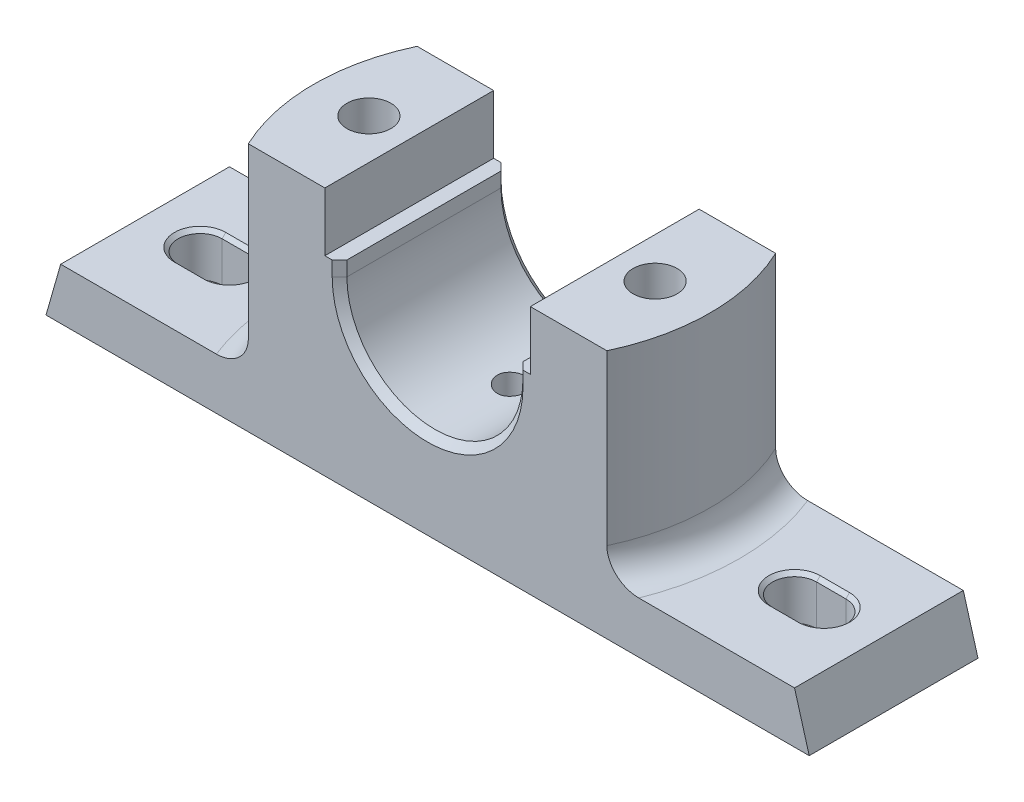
ISO-10303-21;
HEADER;
FILE_DESCRIPTION(('STEP AP214'),'2;1');
FILE_NAME('part.step','',(''),(''),'','','');
FILE_SCHEMA(('AUTOMOTIVE_DESIGN { 1 0 10303 214 1 1 1 1 }'));
ENDSEC;
DATA;
#1=APPLICATION_CONTEXT('core data for automotive mechanical design processes');
#2=APPLICATION_PROTOCOL_DEFINITION('international standard','automotive_design',2000,#1);
#3=PRODUCT_CONTEXT('',#1,'mechanical');
#4=PRODUCT('Part','Part','',(#3));
#5=PRODUCT_RELATED_PRODUCT_CATEGORY('part','',(#4));
#6=PRODUCT_DEFINITION_FORMATION('','',#4);
#7=PRODUCT_DEFINITION_CONTEXT('part definition',#1,'design');
#8=PRODUCT_DEFINITION('design','',#6,#7);
#9=PRODUCT_DEFINITION_SHAPE('','',#8);
#10=(LENGTH_UNIT() NAMED_UNIT(*) SI_UNIT(.MILLI.,.METRE.));
#11=(NAMED_UNIT(*) PLANE_ANGLE_UNIT() SI_UNIT($,.RADIAN.));
#12=(NAMED_UNIT(*) SI_UNIT($,.STERADIAN.) SOLID_ANGLE_UNIT());
#13=UNCERTAINTY_MEASURE_WITH_UNIT(LENGTH_MEASURE(1.E-05),#10,'distance_accuracy_value','');
#14=(GEOMETRIC_REPRESENTATION_CONTEXT(3) GLOBAL_UNCERTAINTY_ASSIGNED_CONTEXT((#13)) GLOBAL_UNIT_ASSIGNED_CONTEXT((#10,
#11,#12)) REPRESENTATION_CONTEXT('',''));
#15=CARTESIAN_POINT('',(0.,0.,0.));
#16=DIRECTION('',(0.,0.,1.));
#17=DIRECTION('',(1.,0.,0.));
#18=AXIS2_PLACEMENT_3D('',#15,#16,#17);
#19=CARTESIAN_POINT('',(-97.5,2.,-17.5));
#20=DIRECTION('',(0.,-1.,0.));
#21=DIRECTION('',(0.,0.,-1.));
#22=AXIS2_PLACEMENT_3D('',#19,#20,#21);
#23=PLANE('',#22);
#24=CARTESIAN_POINT('',(85.,2.,0.));
#25=DIRECTION('',(0.,-1.,0.));
#26=DIRECTION('',(0.,0.,-1.));
#27=AXIS2_PLACEMENT_3D('',#24,#25,#26);
#28=CIRCLE('',#27,6.);
#29=CARTESIAN_POINT('',(85.,2.,-6.00000000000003));
#30=VERTEX_POINT('',#29);
#31=CARTESIAN_POINT('',(85.,2.,5.99999999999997));
#32=VERTEX_POINT('',#31);
#33=EDGE_CURVE('E349',#30,#32,#28,.T.);
#34=ORIENTED_EDGE('',*,*,#33,.F.);
#35=DIRECTION('',(1.,0.,0.));
#36=VECTOR('',#35,1.);
#37=CARTESIAN_POINT('',(-97.5,2.,-5.99999999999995));
#38=LINE('',#37,#36);
#39=CARTESIAN_POINT('',(77.,2.,-6.00000000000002));
#40=VERTEX_POINT('',#39);
#41=EDGE_CURVE('E331',#40,#30,#38,.T.);
#42=ORIENTED_EDGE('',*,*,#41,.F.);
#43=CARTESIAN_POINT('',(77.,2.,0.));
#44=DIRECTION('',(0.,-1.,0.));
#45=DIRECTION('',(0.,0.,-1.));
#46=AXIS2_PLACEMENT_3D('',#43,#44,#45);
#47=CIRCLE('',#46,6.);
#48=CARTESIAN_POINT('',(77.,2.,6.00000000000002));
#49=VERTEX_POINT('',#48);
#50=EDGE_CURVE('E343',#49,#40,#47,.T.);
#51=ORIENTED_EDGE('',*,*,#50,.F.);
#52=DIRECTION('',(-1.,0.,0.));
#53=VECTOR('',#52,1.);
#54=CARTESIAN_POINT('',(-97.5,2.,6.00000000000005));
#55=LINE('',#54,#53);
#56=EDGE_CURVE('E357',#32,#49,#55,.T.);
#57=ORIENTED_EDGE('',*,*,#56,.F.);
#58=EDGE_LOOP('',(#34,#42,#51,#57));
#59=FACE_BOUND('',#58,.T.);
#60=CARTESIAN_POINT('',(-77.,2.,0.));
#61=DIRECTION('',(0.,-1.,0.));
#62=DIRECTION('',(0.,0.,-1.));
#63=AXIS2_PLACEMENT_3D('',#60,#61,#62);
#64=CIRCLE('',#63,6.);
#65=CARTESIAN_POINT('',(-77.,2.,-6.));
#66=VERTEX_POINT('',#65);
#67=CARTESIAN_POINT('',(-77.,2.,6.));
#68=VERTEX_POINT('',#67);
#69=EDGE_CURVE('E381',#66,#68,#64,.T.);
#70=ORIENTED_EDGE('',*,*,#69,.F.);
#71=DIRECTION('',(1.,0.,0.));
#72=VECTOR('',#71,1.);
#73=CARTESIAN_POINT('',(-97.5,2.,-6.00000000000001));
#74=LINE('',#73,#72);
#75=CARTESIAN_POINT('',(-85.,2.,-6.00000000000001));
#76=VERTEX_POINT('',#75);
#77=EDGE_CURVE('E369',#76,#66,#74,.T.);
#78=ORIENTED_EDGE('',*,*,#77,.F.);
#79=CARTESIAN_POINT('',(-85.,2.,0.));
#80=DIRECTION('',(0.,-1.,0.));
#81=DIRECTION('',(0.,0.,-1.));
#82=AXIS2_PLACEMENT_3D('',#79,#80,#81);
#83=CIRCLE('',#82,6.);
#84=CARTESIAN_POINT('',(-85.,2.,5.99999999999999));
#85=VERTEX_POINT('',#84);
#86=EDGE_CURVE('E376',#85,#76,#83,.T.);
#87=ORIENTED_EDGE('',*,*,#86,.F.);
#88=DIRECTION('',(-1.,0.,0.));
#89=VECTOR('',#88,1.);
#90=CARTESIAN_POINT('',(-97.5,2.,5.99999999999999));
#91=LINE('',#90,#89);
#92=EDGE_CURVE('E379',#68,#85,#91,.T.);
#93=ORIENTED_EDGE('',*,*,#92,.F.);
#94=EDGE_LOOP('',(#70,#78,#87,#93));
#95=FACE_BOUND('',#94,.T.);
#96=DIRECTION('',(0.,0.,-1.));
#97=VECTOR('',#96,1.);
#98=CARTESIAN_POINT('',(-97.5,2.,17.5));
#99=LINE('',#98,#97);
#100=CARTESIAN_POINT('',(-97.5,2.,17.5));
#101=VERTEX_POINT('',#100);
#102=CARTESIAN_POINT('',(-97.5,2.,-17.5));
#103=VERTEX_POINT('',#102);
#104=EDGE_CURVE('E469',#101,#103,#99,.T.);
#105=ORIENTED_EDGE('',*,*,#104,.T.);
#106=DIRECTION('',(1.,0.,0.));
#107=VECTOR('',#106,1.);
#108=CARTESIAN_POINT('',(-97.5,2.,-17.5));
#109=LINE('',#108,#107);
#110=CARTESIAN_POINT('',(97.5,2.,-17.5));
#111=VERTEX_POINT('',#110);
#112=EDGE_CURVE('E472',#103,#111,#109,.T.);
#113=ORIENTED_EDGE('',*,*,#112,.T.);
#114=DIRECTION('',(0.,0.,1.));
#115=VECTOR('',#114,1.);
#116=CARTESIAN_POINT('',(97.5,2.,17.5));
#117=LINE('',#116,#115);
#118=CARTESIAN_POINT('',(97.5,2.,17.5));
#119=VERTEX_POINT('',#118);
#120=EDGE_CURVE('E475',#111,#119,#117,.T.);
#121=ORIENTED_EDGE('',*,*,#120,.T.);
#122=DIRECTION('',(-1.,0.,0.));
#123=VECTOR('',#122,1.);
#124=CARTESIAN_POINT('',(-97.5,2.,17.5));
#125=LINE('',#124,#123);
#126=EDGE_CURVE('E478',#119,#101,#125,.T.);
#127=ORIENTED_EDGE('',*,*,#126,.T.);
#128=EDGE_LOOP('',(#105,#113,#121,#127));
#129=FACE_BOUND('',#128,.T.);
#130=DIRECTION('',(0.,0.,-1.));
#131=VECTOR('',#130,1.);
#132=CARTESIAN_POINT('',(26.,2.,13.));
#133=LINE('',#132,#131);
#134=CARTESIAN_POINT('',(26.,2.,13.));
#135=VERTEX_POINT('',#134);
#136=CARTESIAN_POINT('',(26.,2.,-13.));
#137=VERTEX_POINT('',#136);
#138=EDGE_CURVE('E428',#135,#137,#133,.T.);
#139=ORIENTED_EDGE('',*,*,#138,.F.);
#140=DIRECTION('',(1.,0.,0.));
#141=VECTOR('',#140,1.);
#142=CARTESIAN_POINT('',(26.,2.,13.));
#143=LINE('',#142,#141);
#144=CARTESIAN_POINT('',(52.,2.,13.));
#145=VERTEX_POINT('',#144);
#146=EDGE_CURVE('E436',#135,#145,#143,.T.);
#147=ORIENTED_EDGE('',*,*,#146,.T.);
#148=DIRECTION('',(0.,0.,-1.));
#149=VECTOR('',#148,1.);
#150=CARTESIAN_POINT('',(52.,2.,13.));
#151=LINE('',#150,#149);
#152=CARTESIAN_POINT('',(52.,2.,-13.));
#153=VERTEX_POINT('',#152);
#154=EDGE_CURVE('E433',#145,#153,#151,.T.);
#155=ORIENTED_EDGE('',*,*,#154,.T.);
#156=DIRECTION('',(1.,0.,0.));
#157=VECTOR('',#156,1.);
#158=CARTESIAN_POINT('',(26.,2.,-13.));
#159=LINE('',#158,#157);
#160=EDGE_CURVE('E430',#137,#153,#159,.T.);
#161=ORIENTED_EDGE('',*,*,#160,.F.);
#162=EDGE_LOOP('',(#139,#147,#155,#161));
#163=FACE_BOUND('',#162,.T.);
#164=DIRECTION('',(-1.,0.,0.));
#165=VECTOR('',#164,1.);
#166=CARTESIAN_POINT('',(-26.,2.,13.));
#167=LINE('',#166,#165);
#168=CARTESIAN_POINT('',(-26.,2.,13.));
#169=VERTEX_POINT('',#168);
#170=CARTESIAN_POINT('',(-52.,2.,13.));
#171=VERTEX_POINT('',#170);
#172=EDGE_CURVE('E416',#169,#171,#167,.T.);
#173=ORIENTED_EDGE('',*,*,#172,.F.);
#174=DIRECTION('',(0.,0.,-1.));
#175=VECTOR('',#174,1.);
#176=CARTESIAN_POINT('',(-26.,2.,13.));
#177=LINE('',#176,#175);
#178=CARTESIAN_POINT('',(-26.,2.,-13.));
#179=VERTEX_POINT('',#178);
#180=EDGE_CURVE('E425',#169,#179,#177,.T.);
#181=ORIENTED_EDGE('',*,*,#180,.T.);
#182=DIRECTION('',(-1.,0.,0.));
#183=VECTOR('',#182,1.);
#184=CARTESIAN_POINT('',(-26.,2.,-13.));
#185=LINE('',#184,#183);
#186=CARTESIAN_POINT('',(-52.,2.,-13.));
#187=VERTEX_POINT('',#186);
#188=EDGE_CURVE('E422',#179,#187,#185,.T.);
#189=ORIENTED_EDGE('',*,*,#188,.T.);
#190=DIRECTION('',(0.,0.,-1.));
#191=VECTOR('',#190,1.);
#192=CARTESIAN_POINT('',(-52.,2.,13.));
#193=LINE('',#192,#191);
#194=EDGE_CURVE('E419',#171,#187,#193,.T.);
#195=ORIENTED_EDGE('',*,*,#194,.F.);
#196=EDGE_LOOP('',(#173,#181,#189,#195));
#197=FACE_BOUND('',#196,.T.);
#198=ADVANCED_FACE('F32',(#59,#95,#129,#163,#197),#23,.T.);
#199=CARTESIAN_POINT('',(54.,68.,23.));
#200=DIRECTION('',(0.,-1.,0.));
#201=DIRECTION('',(0.,0.,-1.));
#202=AXIS2_PLACEMENT_3D('',#199,#200,#201);
#203=PLANE('',#202);
#204=CARTESIAN_POINT('',(39.,68.,0.));
#205=DIRECTION('',(0.,-1.,0.));
#206=DIRECTION('',(0.,0.,-1.));
#207=AXIS2_PLACEMENT_3D('',#204,#205,#206);
#208=CIRCLE('',#207,6.);
#209=CARTESIAN_POINT('',(39.,68.,-6.));
#210=VERTEX_POINT('',#209);
#211=EDGE_CURVE('E386',#210,#210,#208,.T.);
#212=ORIENTED_EDGE('',*,*,#211,.T.);
#213=EDGE_LOOP('',(#212));
#214=FACE_BOUND('',#213,.T.);
#215=CARTESIAN_POINT('',(0.,68.,0.));
#216=DIRECTION('',(0.,1.,0.));
#217=DIRECTION('',(0.,0.,-1.));
#218=AXIS2_PLACEMENT_3D('',#215,#216,#217);
#219=CIRCLE('',#218,54.);
#220=CARTESIAN_POINT('',(48.8569340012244,68.,23.));
#221=VERTEX_POINT('',#220);
#222=CARTESIAN_POINT('',(48.8569340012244,68.,-23.));
#223=VERTEX_POINT('',#222);
#224=EDGE_CURVE('E491',#221,#223,#219,.T.);
#225=ORIENTED_EDGE('',*,*,#224,.T.);
#226=DIRECTION('',(-1.,0.,0.));
#227=VECTOR('',#226,1.);
#228=CARTESIAN_POINT('',(54.,68.,-23.));
#229=LINE('',#228,#227);
#230=CARTESIAN_POINT('',(28.,68.,-23.));
#231=VERTEX_POINT('',#230);
#232=EDGE_CURVE('E514',#223,#231,#229,.T.);
#233=ORIENTED_EDGE('',*,*,#232,.T.);
#234=DIRECTION('',(0.,0.,-1.));
#235=VECTOR('',#234,1.);
#236=CARTESIAN_POINT('',(28.,68.,23.));
#237=LINE('',#236,#235);
#238=CARTESIAN_POINT('',(28.,68.,23.));
#239=VERTEX_POINT('',#238);
#240=EDGE_CURVE('E580',#239,#231,#237,.T.);
#241=ORIENTED_EDGE('',*,*,#240,.F.);
#242=DIRECTION('',(-1.,0.,0.));
#243=VECTOR('',#242,1.);
#244=CARTESIAN_POINT('',(54.,68.,23.));
#245=LINE('',#244,#243);
#246=EDGE_CURVE('E540',#221,#239,#245,.T.);
#247=ORIENTED_EDGE('',*,*,#246,.F.);
#248=EDGE_LOOP('',(#225,#233,#241,#247));
#249=FACE_BOUND('',#248,.T.);
#250=ADVANCED_FACE('F714',(#214,#249),#203,.F.);
#251=CARTESIAN_POINT('',(-54.,68.,23.));
#252=DIRECTION('',(0.,-1.,0.));
#253=DIRECTION('',(1.,0.,0.));
#254=AXIS2_PLACEMENT_3D('',#251,#252,#253);
#255=PLANE('',#254);
#256=CARTESIAN_POINT('',(-39.,68.,0.));
#257=DIRECTION('',(0.,-1.,0.));
#258=DIRECTION('',(0.,0.,-1.));
#259=AXIS2_PLACEMENT_3D('',#256,#257,#258);
#260=CIRCLE('',#259,6.);
#261=CARTESIAN_POINT('',(-39.,68.,-6.00000000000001));
#262=VERTEX_POINT('',#261);
#263=EDGE_CURVE('E392',#262,#262,#260,.T.);
#264=ORIENTED_EDGE('',*,*,#263,.T.);
#265=EDGE_LOOP('',(#264));
#266=FACE_BOUND('',#265,.T.);
#267=CARTESIAN_POINT('',(0.,68.,0.));
#268=DIRECTION('',(0.,1.,0.));
#269=DIRECTION('',(0.,0.,1.));
#270=AXIS2_PLACEMENT_3D('',#267,#268,#269);
#271=CIRCLE('',#270,54.);
#272=CARTESIAN_POINT('',(-48.8569340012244,68.,-23.));
#273=VERTEX_POINT('',#272);
#274=CARTESIAN_POINT('',(-48.8569340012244,68.,23.));
#275=VERTEX_POINT('',#274);
#276=EDGE_CURVE('E496',#273,#275,#271,.T.);
#277=ORIENTED_EDGE('',*,*,#276,.T.);
#278=DIRECTION('',(-1.,0.,0.));
#279=VECTOR('',#278,1.);
#280=CARTESIAN_POINT('',(-54.,68.,23.));
#281=LINE('',#280,#279);
#282=CARTESIAN_POINT('',(-28.,68.,23.));
#283=VERTEX_POINT('',#282);
#284=EDGE_CURVE('E551',#283,#275,#281,.T.);
#285=ORIENTED_EDGE('',*,*,#284,.F.);
#286=DIRECTION('',(0.,0.,-1.));
#287=VECTOR('',#286,1.);
#288=CARTESIAN_POINT('',(-28.,68.,23.));
#289=LINE('',#288,#287);
#290=CARTESIAN_POINT('',(-28.,68.,-23.));
#291=VERTEX_POINT('',#290);
#292=EDGE_CURVE('E559',#283,#291,#289,.T.);
#293=ORIENTED_EDGE('',*,*,#292,.T.);
#294=DIRECTION('',(-1.,0.,0.));
#295=VECTOR('',#294,1.);
#296=CARTESIAN_POINT('',(-54.,68.,-23.));
#297=LINE('',#296,#295);
#298=EDGE_CURVE('E525',#291,#273,#297,.T.);
#299=ORIENTED_EDGE('',*,*,#298,.T.);
#300=EDGE_LOOP('',(#277,#285,#293,#299));
#301=FACE_BOUND('',#300,.T.);
#302=ADVANCED_FACE('F719',(#266,#301),#255,.F.);
#303=CARTESIAN_POINT('',(-104.,0.,23.));
#304=DIRECTION('',(0.961523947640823,-0.27472112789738,0.));
#305=DIRECTION('',(0.27472112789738,0.961523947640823,0.));
#306=AXIS2_PLACEMENT_3D('',#303,#304,#305);
#307=PLANE('',#306);
#308=DIRECTION('',(-0.27472112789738,-0.961523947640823,0.));
#309=VECTOR('',#308,1.);
#310=CARTESIAN_POINT('',(-104.,0.,-23.));
#311=LINE('',#310,#309);
#312=CARTESIAN_POINT('',(-100.,14.,-23.));
#313=VERTEX_POINT('',#312);
#314=CARTESIAN_POINT('',(-104.,0.,-23.));
#315=VERTEX_POINT('',#314);
#316=EDGE_CURVE('E504',#313,#315,#311,.T.);
#317=ORIENTED_EDGE('',*,*,#316,.T.);
#318=DIRECTION('',(0.,0.,-1.));
#319=VECTOR('',#318,1.);
#320=CARTESIAN_POINT('',(-104.,0.,23.));
#321=LINE('',#320,#319);
#322=CARTESIAN_POINT('',(-104.,0.,23.));
#323=VERTEX_POINT('',#322);
#324=EDGE_CURVE('E589',#323,#315,#321,.T.);
#325=ORIENTED_EDGE('',*,*,#324,.F.);
#326=DIRECTION('',(-0.27472112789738,-0.961523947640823,0.));
#327=VECTOR('',#326,1.);
#328=CARTESIAN_POINT('',(-104.,0.,23.));
#329=LINE('',#328,#327);
#330=CARTESIAN_POINT('',(-100.,14.,23.));
#331=VERTEX_POINT('',#330);
#332=EDGE_CURVE('E530',#331,#323,#329,.T.);
#333=ORIENTED_EDGE('',*,*,#332,.F.);
#334=DIRECTION('',(0.,0.,-1.));
#335=VECTOR('',#334,1.);
#336=CARTESIAN_POINT('',(-100.,14.,23.));
#337=LINE('',#336,#335);
#338=EDGE_CURVE('E556',#331,#313,#337,.T.);
#339=ORIENTED_EDGE('',*,*,#338,.T.);
#340=EDGE_LOOP('',(#317,#325,#333,#339));
#341=FACE_BOUND('',#340,.T.);
#342=ADVANCED_FACE('F34',(#341),#307,.F.);
#343=CARTESIAN_POINT('',(-104.,0.,23.));
#344=DIRECTION('',(0.,1.,0.));
#345=DIRECTION('',(0.,0.,1.));
#346=AXIS2_PLACEMENT_3D('',#343,#344,#345);
#347=PLANE('',#346);
#348=DIRECTION('',(1.,0.,0.));
#349=VECTOR('',#348,1.);
#350=CARTESIAN_POINT('',(-97.5,0.,-17.5));
#351=LINE('',#350,#349);
#352=CARTESIAN_POINT('',(-97.5,0.,-17.5));
#353=VERTEX_POINT('',#352);
#354=CARTESIAN_POINT('',(97.5,0.,-17.5));
#355=VERTEX_POINT('',#354);
#356=EDGE_CURVE('E460',#353,#355,#351,.T.);
#357=ORIENTED_EDGE('',*,*,#356,.F.);
#358=DIRECTION('',(0.,0.,-1.));
#359=VECTOR('',#358,1.);
#360=CARTESIAN_POINT('',(-97.5,0.,17.5));
#361=LINE('',#360,#359);
#362=CARTESIAN_POINT('',(-97.5,0.,17.5));
#363=VERTEX_POINT('',#362);
#364=EDGE_CURVE('E452',#363,#353,#361,.T.);
#365=ORIENTED_EDGE('',*,*,#364,.F.);
#366=DIRECTION('',(-1.,0.,0.));
#367=VECTOR('',#366,1.);
#368=CARTESIAN_POINT('',(-97.5,0.,17.5));
#369=LINE('',#368,#367);
#370=CARTESIAN_POINT('',(97.5,0.,17.5));
#371=VERTEX_POINT('',#370);
#372=EDGE_CURVE('E466',#371,#363,#369,.T.);
#373=ORIENTED_EDGE('',*,*,#372,.F.);
#374=DIRECTION('',(0.,0.,1.));
#375=VECTOR('',#374,1.);
#376=CARTESIAN_POINT('',(97.5,0.,17.5));
#377=LINE('',#376,#375);
#378=EDGE_CURVE('E463',#355,#371,#377,.T.);
#379=ORIENTED_EDGE('',*,*,#378,.F.);
#380=EDGE_LOOP('',(#357,#365,#373,#379));
#381=FACE_BOUND('',#380,.T.);
#382=DIRECTION('',(1.,0.,0.));
#383=VECTOR('',#382,1.);
#384=CARTESIAN_POINT('',(-104.,0.,-23.));
#385=LINE('',#384,#383);
#386=CARTESIAN_POINT('',(104.,0.,-23.));
#387=VERTEX_POINT('',#386);
#388=EDGE_CURVE('E507',#315,#387,#385,.T.);
#389=ORIENTED_EDGE('',*,*,#388,.T.);
#390=DIRECTION('',(0.,0.,-1.));
#391=VECTOR('',#390,1.);
#392=CARTESIAN_POINT('',(104.,0.,23.));
#393=LINE('',#392,#391);
#394=CARTESIAN_POINT('',(104.,0.,23.));
#395=VERTEX_POINT('',#394);
#396=EDGE_CURVE('E586',#395,#387,#393,.T.);
#397=ORIENTED_EDGE('',*,*,#396,.F.);
#398=DIRECTION('',(1.,0.,0.));
#399=VECTOR('',#398,1.);
#400=CARTESIAN_POINT('',(-104.,0.,23.));
#401=LINE('',#400,#399);
#402=EDGE_CURVE('E533',#323,#395,#401,.T.);
#403=ORIENTED_EDGE('',*,*,#402,.F.);
#404=ORIENTED_EDGE('',*,*,#324,.T.);
#405=EDGE_LOOP('',(#389,#397,#403,#404));
#406=FACE_BOUND('',#405,.T.);
#407=ADVANCED_FACE('F771',(#381,#406),#347,.F.);
#408=CARTESIAN_POINT('',(104.,0.,23.));
#409=DIRECTION('',(-0.961523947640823,-0.274721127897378,0.));
#410=DIRECTION('',(0.274721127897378,-0.961523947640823,0.));
#411=AXIS2_PLACEMENT_3D('',#408,#409,#410);
#412=PLANE('',#411);
#413=DIRECTION('',(-0.274721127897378,0.961523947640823,0.));
#414=VECTOR('',#413,1.);
#415=CARTESIAN_POINT('',(104.,0.,-23.));
#416=LINE('',#415,#414);
#417=CARTESIAN_POINT('',(100.,14.,-23.));
#418=VERTEX_POINT('',#417);
#419=EDGE_CURVE('E509',#387,#418,#416,.T.);
#420=ORIENTED_EDGE('',*,*,#419,.T.);
#421=DIRECTION('',(0.,0.,-1.));
#422=VECTOR('',#421,1.);
#423=CARTESIAN_POINT('',(100.,14.,23.));
#424=LINE('',#423,#422);
#425=CARTESIAN_POINT('',(100.,14.,23.));
#426=VERTEX_POINT('',#425);
#427=EDGE_CURVE('E583',#426,#418,#424,.T.);
#428=ORIENTED_EDGE('',*,*,#427,.F.);
#429=DIRECTION('',(-0.274721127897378,0.961523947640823,0.));
#430=VECTOR('',#429,1.);
#431=CARTESIAN_POINT('',(104.,0.,23.));
#432=LINE('',#431,#430);
#433=EDGE_CURVE('E535',#395,#426,#432,.T.);
#434=ORIENTED_EDGE('',*,*,#433,.F.);
#435=ORIENTED_EDGE('',*,*,#396,.T.);
#436=EDGE_LOOP('',(#420,#428,#434,#435));
#437=FACE_BOUND('',#436,.T.);
#438=ADVANCED_FACE('F774',(#437),#412,.F.);
#439=CARTESIAN_POINT('',(100.,14.,23.));
#440=DIRECTION('',(0.,-1.,0.));
#441=DIRECTION('',(1.,0.,0.));
#442=AXIS2_PLACEMENT_3D('',#439,#440,#441);
#443=PLANE('',#442);
#444=CARTESIAN_POINT('',(77.,14.,0.));
#445=DIRECTION('',(0.,-1.,0.));
#446=DIRECTION('',(1.,0.,0.));
#447=AXIS2_PLACEMENT_3D('',#444,#445,#446);
#448=CIRCLE('',#447,7.);
#449=CARTESIAN_POINT('',(77.,14.,6.99999999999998));
#450=VERTEX_POINT('',#449);
#451=CARTESIAN_POINT('',(77.,14.,-6.99999999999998));
#452=VERTEX_POINT('',#451);
#453=EDGE_CURVE('E837',#450,#452,#448,.T.);
#454=ORIENTED_EDGE('',*,*,#453,.T.);
#455=DIRECTION('',(1.,0.,0.));
#456=VECTOR('',#455,1.);
#457=CARTESIAN_POINT('',(100.,14.,-7.00000000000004));
#458=LINE('',#457,#456);
#459=CARTESIAN_POINT('',(85.,14.,-6.99999999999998));
#460=VERTEX_POINT('',#459);
#461=EDGE_CURVE('E834',#452,#460,#458,.T.);
#462=ORIENTED_EDGE('',*,*,#461,.T.);
#463=CARTESIAN_POINT('',(85.,14.,0.));
#464=DIRECTION('',(0.,-1.,0.));
#465=DIRECTION('',(1.,0.,0.));
#466=AXIS2_PLACEMENT_3D('',#463,#464,#465);
#467=CIRCLE('',#466,7.);
#468=CARTESIAN_POINT('',(85.,14.,6.99999999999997));
#469=VERTEX_POINT('',#468);
#470=EDGE_CURVE('E839',#460,#469,#467,.T.);
#471=ORIENTED_EDGE('',*,*,#470,.T.);
#472=DIRECTION('',(-1.,0.,0.));
#473=VECTOR('',#472,1.);
#474=CARTESIAN_POINT('',(100.,14.,6.99999999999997));
#475=LINE('',#474,#473);
#476=EDGE_CURVE('E841',#469,#450,#475,.T.);
#477=ORIENTED_EDGE('',*,*,#476,.T.);
#478=EDGE_LOOP('',(#454,#462,#471,#477));
#479=FACE_BOUND('',#478,.T.);
#480=DIRECTION('',(-1.,0.,0.));
#481=VECTOR('',#480,1.);
#482=CARTESIAN_POINT('',(100.,14.,-23.));
#483=LINE('',#482,#481);
#484=CARTESIAN_POINT('',(57.5760366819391,14.,-23.));
#485=VERTEX_POINT('',#484);
#486=EDGE_CURVE('E511',#418,#485,#483,.T.);
#487=ORIENTED_EDGE('',*,*,#486,.T.);
#488=CARTESIAN_POINT('',(0.,14.,0.));
#489=DIRECTION('',(0.,-1.,0.));
#490=DIRECTION('',(1.,0.,0.));
#491=AXIS2_PLACEMENT_3D('',#488,#489,#490);
#492=CIRCLE('',#491,62.);
#493=CARTESIAN_POINT('',(57.5760366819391,14.,23.));
#494=VERTEX_POINT('',#493);
#495=EDGE_CURVE('E600',#485,#494,#492,.T.);
#496=ORIENTED_EDGE('',*,*,#495,.T.);
#497=DIRECTION('',(-1.,0.,0.));
#498=VECTOR('',#497,1.);
#499=CARTESIAN_POINT('',(100.,14.,23.));
#500=LINE('',#499,#498);
#501=EDGE_CURVE('E537',#426,#494,#500,.T.);
#502=ORIENTED_EDGE('',*,*,#501,.F.);
#503=ORIENTED_EDGE('',*,*,#427,.T.);
#504=EDGE_LOOP('',(#487,#496,#502,#503));
#505=FACE_BOUND('',#504,.T.);
#506=ADVANCED_FACE('F778',(#479,#505),#443,.F.);
#507=CARTESIAN_POINT('',(28.,68.,23.));
#508=DIRECTION('',(1.,0.,0.));
#509=DIRECTION('',(0.,0.,-1.));
#510=AXIS2_PLACEMENT_3D('',#507,#508,#509);
#511=PLANE('',#510);
#512=DIRECTION('',(0.,-1.,0.));
#513=VECTOR('',#512,1.);
#514=CARTESIAN_POINT('',(28.,68.,-23.));
#515=LINE('',#514,#513);
#516=CARTESIAN_POINT('',(28.,52.,-23.));
#517=VERTEX_POINT('',#516);
#518=EDGE_CURVE('E516',#231,#517,#515,.T.);
#519=ORIENTED_EDGE('',*,*,#518,.T.);
#520=DIRECTION('',(0.,0.,-1.));
#521=VECTOR('',#520,1.);
#522=CARTESIAN_POINT('',(28.,52.,23.));
#523=LINE('',#522,#521);
#524=CARTESIAN_POINT('',(28.,52.,23.));
#525=VERTEX_POINT('',#524);
#526=EDGE_CURVE('E577',#525,#517,#523,.T.);
#527=ORIENTED_EDGE('',*,*,#526,.F.);
#528=DIRECTION('',(0.,-1.,0.));
#529=VECTOR('',#528,1.);
#530=CARTESIAN_POINT('',(28.,68.,23.));
#531=LINE('',#530,#529);
#532=EDGE_CURVE('E542',#239,#525,#531,.T.);
#533=ORIENTED_EDGE('',*,*,#532,.F.);
#534=ORIENTED_EDGE('',*,*,#240,.T.);
#535=EDGE_LOOP('',(#519,#527,#533,#534));
#536=FACE_BOUND('',#535,.T.);
#537=ADVANCED_FACE('F793',(#536),#511,.F.);
#538=CARTESIAN_POINT('',(28.,52.,23.));
#539=DIRECTION('',(0.,-1.,0.));
#540=DIRECTION('',(1.,0.,0.));
#541=AXIS2_PLACEMENT_3D('',#538,#539,#540);
#542=PLANE('',#541);
#543=DIRECTION('',(-1.,0.,0.));
#544=VECTOR('',#543,1.);
#545=CARTESIAN_POINT('',(28.,52.,-23.));
#546=LINE('',#545,#544);
#547=CARTESIAN_POINT('',(26.,52.,-23.));
#548=VERTEX_POINT('',#547);
#549=EDGE_CURVE('E518',#517,#548,#546,.T.);
#550=ORIENTED_EDGE('',*,*,#549,.T.);
#551=DIRECTION('',(0.707106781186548,0.,-0.707106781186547));
#552=VECTOR('',#551,1.);
#553=CARTESIAN_POINT('',(24.,52.,-21.));
#554=LINE('',#553,#552);
#555=CARTESIAN_POINT('',(24.,52.,-21.));
#556=VERTEX_POINT('',#555);
#557=EDGE_CURVE('E815',#548,#556,#554,.F.);
#558=ORIENTED_EDGE('',*,*,#557,.T.);
#559=DIRECTION('',(0.,0.,-1.));
#560=VECTOR('',#559,1.);
#561=CARTESIAN_POINT('',(24.,52.,23.));
#562=LINE('',#561,#560);
#563=CARTESIAN_POINT('',(24.,52.,21.));
#564=VERTEX_POINT('',#563);
#565=EDGE_CURVE('E574',#564,#556,#562,.T.);
#566=ORIENTED_EDGE('',*,*,#565,.F.);
#567=DIRECTION('',(0.707106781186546,0.,0.707106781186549));
#568=VECTOR('',#567,1.);
#569=CARTESIAN_POINT('',(26.,52.,23.));
#570=LINE('',#569,#568);
#571=CARTESIAN_POINT('',(26.,52.,23.));
#572=VERTEX_POINT('',#571);
#573=EDGE_CURVE('E798',#564,#572,#570,.T.);
#574=ORIENTED_EDGE('',*,*,#573,.T.);
#575=DIRECTION('',(-1.,0.,0.));
#576=VECTOR('',#575,1.);
#577=CARTESIAN_POINT('',(28.,52.,23.));
#578=LINE('',#577,#576);
#579=EDGE_CURVE('E544',#525,#572,#578,.T.);
#580=ORIENTED_EDGE('',*,*,#579,.F.);
#581=ORIENTED_EDGE('',*,*,#526,.T.);
#582=EDGE_LOOP('',(#550,#558,#566,#574,#580,#581));
#583=FACE_BOUND('',#582,.T.);
#584=ADVANCED_FACE('F959',(#583),#542,.F.);
#585=CARTESIAN_POINT('',(24.,52.,23.));
#586=DIRECTION('',(1.,0.,0.));
#587=DIRECTION('',(0.,1.,0.));
#588=AXIS2_PLACEMENT_3D('',#585,#586,#587);
#589=PLANE('',#588);
#590=ORIENTED_EDGE('',*,*,#565,.T.);
#591=DIRECTION('',(0.,-1.,0.));
#592=VECTOR('',#591,1.);
#593=CARTESIAN_POINT('',(24.,52.,-21.));
#594=LINE('',#593,#592);
#595=CARTESIAN_POINT('',(24.,48.,-21.));
#596=VERTEX_POINT('',#595);
#597=EDGE_CURVE('E824',#556,#596,#594,.T.);
#598=ORIENTED_EDGE('',*,*,#597,.T.);
#599=DIRECTION('',(0.,0.,-1.));
#600=VECTOR('',#599,1.);
#601=CARTESIAN_POINT('',(24.,48.,23.));
#602=LINE('',#601,#600);
#603=CARTESIAN_POINT('',(24.,48.,21.));
#604=VERTEX_POINT('',#603);
#605=EDGE_CURVE('E571',#604,#596,#602,.T.);
#606=ORIENTED_EDGE('',*,*,#605,.F.);
#607=DIRECTION('',(0.,1.,0.));
#608=VECTOR('',#607,1.);
#609=CARTESIAN_POINT('',(24.,52.,21.));
#610=LINE('',#609,#608);
#611=EDGE_CURVE('E827',#604,#564,#610,.T.);
#612=ORIENTED_EDGE('',*,*,#611,.T.);
#613=EDGE_LOOP('',(#590,#598,#606,#612));
#614=FACE_BOUND('',#613,.T.);
#615=ADVANCED_FACE('F961',(#614),#589,.F.);
#616=CARTESIAN_POINT('',(0.,48.,23.));
#617=DIRECTION('',(0.,0.,-1.));
#618=DIRECTION('',(-1.,0.,0.));
#619=AXIS2_PLACEMENT_3D('',#616,#617,#618);
#620=CYLINDRICAL_SURFACE('',#619,24.);
#621=CARTESIAN_POINT('',(0.,24.,-4.));
#622=CARTESIAN_POINT('',(0.223025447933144,24.0000038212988,-3.99999105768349));
#623=CARTESIAN_POINT('',(0.446172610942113,24.0031411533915,-3.98128436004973));
#624=CARTESIAN_POINT('',(0.886208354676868,24.0153544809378,-3.90698294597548));
#625=CARTESIAN_POINT('',(1.10309098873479,24.0244359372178,-3.85135430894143));
#626=CARTESIAN_POINT('',(1.52416759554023,24.0475189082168,-3.70493528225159));
#627=CARTESIAN_POINT('',(1.72837178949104,24.0615163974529,-3.61417365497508));
#628=CARTESIAN_POINT('',(2.11862694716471,24.0928923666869,-3.40014033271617));
#629=CARTESIAN_POINT('',(2.30467998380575,24.1102704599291,-3.2768723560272));
#630=CARTESIAN_POINT('',(2.65515618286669,24.146666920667,-3.00007186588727));
#631=CARTESIAN_POINT('',(2.81938064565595,24.1656980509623,-2.84628941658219));
#632=CARTESIAN_POINT('',(3.11982159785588,24.2031579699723,-2.5133632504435));
#633=CARTESIAN_POINT('',(3.25603631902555,24.2215867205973,-2.33421793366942));
#634=CARTESIAN_POINT('',(3.49738740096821,24.2558789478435,-1.95428645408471));
#635=CARTESIAN_POINT('',(3.6023272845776,24.2717259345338,-1.75337386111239));
#636=CARTESIAN_POINT('',(3.77689338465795,24.2988833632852,-1.336464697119));
#637=CARTESIAN_POINT('',(3.84652198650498,24.3101941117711,-1.12046914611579));
#638=CARTESIAN_POINT('',(3.94786300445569,24.3268714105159,-0.681631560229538));
#639=CARTESIAN_POINT('',(3.97991844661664,24.3322917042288,-0.458870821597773));
#640=CARTESIAN_POINT('',(4.0062667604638,24.3367369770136,-0.0110715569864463));
#641=CARTESIAN_POINT('',(4.00056230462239,24.3357624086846,0.213966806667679));
#642=CARTESIAN_POINT('',(3.95183215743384,24.3275771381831,0.657484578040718));
#643=CARTESIAN_POINT('',(3.90919181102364,24.3204308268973,0.876007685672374));
#644=CARTESIAN_POINT('',(3.78840502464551,24.3008080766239,1.30275410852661));
#645=CARTESIAN_POINT('',(3.71025736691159,24.2883314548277,1.51097707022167));
#646=CARTESIAN_POINT('',(3.52028359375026,24.2593843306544,1.91236611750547));
#647=CARTESIAN_POINT('',(3.40829746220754,24.2428949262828,2.10545504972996));
#648=CARTESIAN_POINT('',(3.15393922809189,24.2077933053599,2.47024704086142));
#649=CARTESIAN_POINT('',(3.01156467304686,24.1891809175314,2.64194837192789));
#650=CARTESIAN_POINT('',(2.69837153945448,24.1516475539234,2.96132173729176));
#651=CARTESIAN_POINT('',(2.527222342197,24.1327256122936,3.10866962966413));
#652=CARTESIAN_POINT('',(2.16245639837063,24.0969183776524,3.37260442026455));
#653=CARTESIAN_POINT('',(1.96883950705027,24.0800330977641,3.48919112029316));
#654=CARTESIAN_POINT('',(1.56432946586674,24.0501777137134,3.68832356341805));
#655=CARTESIAN_POINT('',(1.35342196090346,24.0372109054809,3.77084067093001));
#656=CARTESIAN_POINT('',(0.920477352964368,24.0166799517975,3.89919074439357));
#657=CARTESIAN_POINT('',(0.698441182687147,24.0091153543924,3.94502677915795));
#658=CARTESIAN_POINT('',(0.252335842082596,24.000301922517,3.99827417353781));
#659=CARTESIAN_POINT('',(0.0283211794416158,23.9989799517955,4.00613051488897));
#660=CARTESIAN_POINT('',(-0.417823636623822,24.0026004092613,3.984381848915));
#661=CARTESIAN_POINT('',(-0.639953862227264,24.0075425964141,3.95477828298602));
#662=CARTESIAN_POINT('',(-1.07464988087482,24.0230907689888,3.85932024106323));
#663=CARTESIAN_POINT('',(-1.28726538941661,24.033662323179,3.7936860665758));
#664=CARTESIAN_POINT('',(-1.69847501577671,24.0592885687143,3.62826477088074));
#665=CARTESIAN_POINT('',(-1.89706834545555,24.0743435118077,3.52847573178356));
#666=CARTESIAN_POINT('',(-2.27652910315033,24.1074477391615,3.29655820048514));
#667=CARTESIAN_POINT('',(-2.45722440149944,24.1255223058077,3.1641517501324));
#668=CARTESIAN_POINT('',(-2.7939897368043,24.1625845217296,2.8711402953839));
#669=CARTESIAN_POINT('',(-2.95005798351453,24.1815722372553,2.71053324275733));
#670=CARTESIAN_POINT('',(-3.2347884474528,24.2185571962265,2.36368392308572));
#671=CARTESIAN_POINT('',(-3.36315001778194,24.2365421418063,2.17719333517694));
#672=CARTESIAN_POINT('',(-3.58672369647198,24.2692555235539,1.78503524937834));
#673=CARTESIAN_POINT('',(-3.68193685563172,24.2839840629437,1.57936835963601));
#674=CARTESIAN_POINT('',(-3.83606133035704,24.3084247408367,1.15553642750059));
#675=CARTESIAN_POINT('',(-3.89512229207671,24.318157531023,0.937427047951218));
#676=CARTESIAN_POINT('',(-3.97573672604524,24.3315565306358,0.49420779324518));
#677=CARTESIAN_POINT('',(-3.99729345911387,24.3352232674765,0.269098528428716));
#678=CARTESIAN_POINT('',(-4.00219658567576,24.3360522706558,-0.178728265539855));
#679=CARTESIAN_POINT('',(-3.9860162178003,24.3332950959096,-0.401440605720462));
#680=CARTESIAN_POINT('',(-3.91692774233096,24.3217634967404,-0.840926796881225));
#681=CARTESIAN_POINT('',(-3.86401975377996,24.3129890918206,-1.057700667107));
#682=CARTESIAN_POINT('',(-3.72315918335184,24.2904422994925,-1.47897349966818));
#683=CARTESIAN_POINT('',(-3.63524734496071,24.2766757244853,-1.68348641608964));
#684=CARTESIAN_POINT('',(-3.42692320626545,24.2456900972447,-2.07493707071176));
#685=CARTESIAN_POINT('',(-3.3065092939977,24.2284708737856,-2.26187393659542));
#686=CARTESIAN_POINT('',(-3.03491021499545,24.1922647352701,-2.61525693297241));
#687=CARTESIAN_POINT('',(-2.88337690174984,24.1732592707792,-2.78143362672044));
#688=CARTESIAN_POINT('',(-2.55457445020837,24.1357700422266,-3.0861625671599));
#689=CARTESIAN_POINT('',(-2.37729938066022,24.1172863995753,-3.22470842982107));
#690=CARTESIAN_POINT('',(-2.00059067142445,24.0827755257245,-3.47111722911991));
#691=CARTESIAN_POINT('',(-1.80101246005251,24.0667661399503,-3.57876166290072));
#692=CARTESIAN_POINT('',(-1.38642091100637,24.0391813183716,-3.75883117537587));
#693=CARTESIAN_POINT('',(-1.17142319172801,24.0276014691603,-3.83129132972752));
#694=CARTESIAN_POINT('',(-0.79632529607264,24.0127073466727,-3.92320843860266));
#695=CARTESIAN_POINT('',(-0.638494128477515,24.0079675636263,-3.95195915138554));
#696=CARTESIAN_POINT('',(-0.320462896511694,24.0016125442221,-3.9903579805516));
#697=CARTESIAN_POINT('',(-0.16026287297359,23.9999972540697,-4.00000642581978));
#698=CARTESIAN_POINT('',(0.,24.,-4.));
#699=B_SPLINE_CURVE_WITH_KNOTS('',3,(#621,#622,#623,#624,#625,#626,#627,#628,#629,#630,#631,
#632,#633,#634,#635,#636,#637,#638,#639,#640,#641,#642,#643,#644,#645,#646,#647,#648,#649,#650,
#651,#652,#653,#654,#655,#656,#657,#658,#659,#660,#661,#662,#663,#664,#665,#666,#667,#668,#669,
#670,#671,#672,#673,#674,#675,#676,#677,#678,#679,#680,#681,#682,#683,#684,#685,#686,#687,#688,
#689,#690,#691,#692,#693,#694,#695,#696,#697,#698),.UNSPECIFIED.,.T.,.F.,(4,2,2,2,2,2,2,2,2,2,2,
2,2,2,2,2,2,2,2,2,2,2,2,2,2,2,2,2,2,2,2,2,2,2,2,2,2,2,4),(0.,0.668490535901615,1.33759607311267,
2.00615498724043,2.67463746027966,3.34883985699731,4.02308480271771,4.70148033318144,
5.3798300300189,6.05193723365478,6.72399686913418,7.38912834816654,8.0542826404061,
8.72263290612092,9.39103713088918,10.0677243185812,10.7444158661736,11.4216750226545,
12.0988775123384,12.7681261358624,13.4373490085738,14.1025249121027,14.7677381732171,
15.4388292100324,16.1099690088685,16.7880611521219,17.4661317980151,18.1413763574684,
18.8165622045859,19.4833265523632,20.1500887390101,20.8160770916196,21.4820984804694,
22.1560221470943,22.8301013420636,23.5088357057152,24.1868920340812,24.6672679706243,
25.1476356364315),.UNSPECIFIED.);
#700=CARTESIAN_POINT('',(0.,24.,-4.));
#701=VERTEX_POINT('',#700);
#702=EDGE_CURVE('E11',#701,#701,#699,.T.);
#703=ORIENTED_EDGE('',*,*,#702,.T.);
#704=EDGE_LOOP('',(#703));
#705=FACE_BOUND('',#704,.T.);
#706=ORIENTED_EDGE('',*,*,#605,.T.);
#707=CARTESIAN_POINT('',(0.,48.,-21.));
#708=DIRECTION('',(0.,0.,1.));
#709=DIRECTION('',(1.,0.,0.));
#710=AXIS2_PLACEMENT_3D('',#707,#708,#709);
#711=CIRCLE('',#710,24.);
#712=CARTESIAN_POINT('',(-24.,48.,-21.));
#713=VERTEX_POINT('',#712);
#714=EDGE_CURVE('E803',#596,#713,#711,.F.);
#715=ORIENTED_EDGE('',*,*,#714,.T.);
#716=DIRECTION('',(0.,0.,-1.));
#717=VECTOR('',#716,1.);
#718=CARTESIAN_POINT('',(-24.,48.,23.));
#719=LINE('',#718,#717);
#720=CARTESIAN_POINT('',(-24.,48.,21.));
#721=VERTEX_POINT('',#720);
#722=EDGE_CURVE('E568',#721,#713,#719,.T.);
#723=ORIENTED_EDGE('',*,*,#722,.F.);
#724=CARTESIAN_POINT('',(0.,48.,21.));
#725=DIRECTION('',(0.,0.,1.));
#726=DIRECTION('',(1.,0.,0.));
#727=AXIS2_PLACEMENT_3D('',#724,#725,#726);
#728=CIRCLE('',#727,24.);
#729=EDGE_CURVE('E805',#721,#604,#728,.T.);
#730=ORIENTED_EDGE('',*,*,#729,.T.);
#731=EDGE_LOOP('',(#706,#715,#723,#730));
#732=FACE_BOUND('',#731,.T.);
#733=ADVANCED_FACE('F964',(#705,#732),#620,.F.);
#734=CARTESIAN_POINT('',(-24.,52.,23.));
#735=DIRECTION('',(-1.,0.,0.));
#736=DIRECTION('',(0.,-1.,0.));
#737=AXIS2_PLACEMENT_3D('',#734,#735,#736);
#738=PLANE('',#737);
#739=ORIENTED_EDGE('',*,*,#722,.T.);
#740=DIRECTION('',(0.,1.,0.));
#741=VECTOR('',#740,1.);
#742=CARTESIAN_POINT('',(-24.,52.,-21.));
#743=LINE('',#742,#741);
#744=CARTESIAN_POINT('',(-24.,52.,-21.));
#745=VERTEX_POINT('',#744);
#746=EDGE_CURVE('E811',#713,#745,#743,.T.);
#747=ORIENTED_EDGE('',*,*,#746,.T.);
#748=DIRECTION('',(0.,0.,-1.));
#749=VECTOR('',#748,1.);
#750=CARTESIAN_POINT('',(-24.,52.,23.));
#751=LINE('',#750,#749);
#752=CARTESIAN_POINT('',(-24.,52.,21.));
#753=VERTEX_POINT('',#752);
#754=EDGE_CURVE('E565',#753,#745,#751,.T.);
#755=ORIENTED_EDGE('',*,*,#754,.F.);
#756=DIRECTION('',(0.,-1.,0.));
#757=VECTOR('',#756,1.);
#758=CARTESIAN_POINT('',(-24.,48.,21.));
#759=LINE('',#758,#757);
#760=EDGE_CURVE('E813',#753,#721,#759,.T.);
#761=ORIENTED_EDGE('',*,*,#760,.T.);
#762=EDGE_LOOP('',(#739,#747,#755,#761));
#763=FACE_BOUND('',#762,.T.);
#764=ADVANCED_FACE('F967',(#763),#738,.F.);
#765=CARTESIAN_POINT('',(-28.,52.,23.));
#766=DIRECTION('',(0.,-1.,0.));
#767=DIRECTION('',(1.,0.,0.));
#768=AXIS2_PLACEMENT_3D('',#765,#766,#767);
#769=PLANE('',#768);
#770=ORIENTED_EDGE('',*,*,#754,.T.);
#771=DIRECTION('',(0.707106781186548,0.,0.707106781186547));
#772=VECTOR('',#771,1.);
#773=CARTESIAN_POINT('',(-24.,52.,-21.));
#774=LINE('',#773,#772);
#775=CARTESIAN_POINT('',(-26.,52.,-23.));
#776=VERTEX_POINT('',#775);
#777=EDGE_CURVE('E807',#745,#776,#774,.F.);
#778=ORIENTED_EDGE('',*,*,#777,.T.);
#779=DIRECTION('',(-1.,0.,0.));
#780=VECTOR('',#779,1.);
#781=CARTESIAN_POINT('',(-28.,52.,-23.));
#782=LINE('',#781,#780);
#783=CARTESIAN_POINT('',(-28.,52.,-23.));
#784=VERTEX_POINT('',#783);
#785=EDGE_CURVE('E521',#776,#784,#782,.T.);
#786=ORIENTED_EDGE('',*,*,#785,.T.);
#787=DIRECTION('',(0.,0.,-1.));
#788=VECTOR('',#787,1.);
#789=CARTESIAN_POINT('',(-28.,52.,23.));
#790=LINE('',#789,#788);
#791=CARTESIAN_POINT('',(-28.,52.,23.));
#792=VERTEX_POINT('',#791);
#793=EDGE_CURVE('E562',#792,#784,#790,.T.);
#794=ORIENTED_EDGE('',*,*,#793,.F.);
#795=DIRECTION('',(-1.,0.,0.));
#796=VECTOR('',#795,1.);
#797=CARTESIAN_POINT('',(-28.,52.,23.));
#798=LINE('',#797,#796);
#799=CARTESIAN_POINT('',(-26.,52.,23.));
#800=VERTEX_POINT('',#799);
#801=EDGE_CURVE('E547',#800,#792,#798,.T.);
#802=ORIENTED_EDGE('',*,*,#801,.F.);
#803=DIRECTION('',(0.707106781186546,0.,-0.707106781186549));
#804=VECTOR('',#803,1.);
#805=CARTESIAN_POINT('',(-26.,52.,23.));
#806=LINE('',#805,#804);
#807=EDGE_CURVE('E809',#800,#753,#806,.T.);
#808=ORIENTED_EDGE('',*,*,#807,.T.);
#809=EDGE_LOOP('',(#770,#778,#786,#794,#802,#808));
#810=FACE_BOUND('',#809,.T.);
#811=ADVANCED_FACE('F938',(#810),#769,.F.);
#812=CARTESIAN_POINT('',(-28.,68.,23.));
#813=DIRECTION('',(-1.,0.,0.));
#814=DIRECTION('',(0.,0.,1.));
#815=AXIS2_PLACEMENT_3D('',#812,#813,#814);
#816=PLANE('',#815);
#817=DIRECTION('',(0.,1.,0.));
#818=VECTOR('',#817,1.);
#819=CARTESIAN_POINT('',(-28.,68.,-23.));
#820=LINE('',#819,#818);
#821=EDGE_CURVE('E523',#784,#291,#820,.T.);
#822=ORIENTED_EDGE('',*,*,#821,.T.);
#823=ORIENTED_EDGE('',*,*,#292,.F.);
#824=DIRECTION('',(0.,1.,0.));
#825=VECTOR('',#824,1.);
#826=CARTESIAN_POINT('',(-28.,68.,23.));
#827=LINE('',#826,#825);
#828=EDGE_CURVE('E549',#792,#283,#827,.T.);
#829=ORIENTED_EDGE('',*,*,#828,.F.);
#830=ORIENTED_EDGE('',*,*,#793,.T.);
#831=EDGE_LOOP('',(#822,#823,#829,#830));
#832=FACE_BOUND('',#831,.T.);
#833=ADVANCED_FACE('F945',(#832),#816,.F.);
#834=CARTESIAN_POINT('',(-100.,14.,23.));
#835=DIRECTION('',(0.,-1.,0.));
#836=DIRECTION('',(1.,0.,0.));
#837=AXIS2_PLACEMENT_3D('',#834,#835,#836);
#838=PLANE('',#837);
#839=CARTESIAN_POINT('',(-85.,14.,0.));
#840=DIRECTION('',(0.,-1.,0.));
#841=DIRECTION('',(1.,0.,0.));
#842=AXIS2_PLACEMENT_3D('',#839,#840,#841);
#843=CIRCLE('',#842,6.99999999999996);
#844=CARTESIAN_POINT('',(-85.,14.,6.99999999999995));
#845=VERTEX_POINT('',#844);
#846=CARTESIAN_POINT('',(-85.,14.,-6.99999999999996));
#847=VERTEX_POINT('',#846);
#848=EDGE_CURVE('E854',#845,#847,#843,.T.);
#849=ORIENTED_EDGE('',*,*,#848,.T.);
#850=DIRECTION('',(1.,0.,0.));
#851=VECTOR('',#850,1.);
#852=CARTESIAN_POINT('',(-100.,14.,-6.99999999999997));
#853=LINE('',#852,#851);
#854=CARTESIAN_POINT('',(-77.,14.,-6.99999999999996));
#855=VERTEX_POINT('',#854);
#856=EDGE_CURVE('E851',#847,#855,#853,.T.);
#857=ORIENTED_EDGE('',*,*,#856,.T.);
#858=CARTESIAN_POINT('',(-77.,14.,0.));
#859=DIRECTION('',(0.,-1.,0.));
#860=DIRECTION('',(1.,0.,0.));
#861=AXIS2_PLACEMENT_3D('',#858,#859,#860);
#862=CIRCLE('',#861,6.99999999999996);
#863=CARTESIAN_POINT('',(-77.,14.,6.99999999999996));
#864=VERTEX_POINT('',#863);
#865=EDGE_CURVE('E856',#855,#864,#862,.T.);
#866=ORIENTED_EDGE('',*,*,#865,.T.);
#867=DIRECTION('',(-1.,0.,0.));
#868=VECTOR('',#867,1.);
#869=CARTESIAN_POINT('',(-100.,14.,6.99999999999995));
#870=LINE('',#869,#868);
#871=EDGE_CURVE('E857',#864,#845,#870,.T.);
#872=ORIENTED_EDGE('',*,*,#871,.T.);
#873=EDGE_LOOP('',(#849,#857,#866,#872));
#874=FACE_BOUND('',#873,.T.);
#875=DIRECTION('',(-1.,0.,0.));
#876=VECTOR('',#875,1.);
#877=CARTESIAN_POINT('',(-100.,14.,23.));
#878=LINE('',#877,#876);
#879=CARTESIAN_POINT('',(-57.5760366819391,14.,23.));
#880=VERTEX_POINT('',#879);
#881=EDGE_CURVE('E554',#880,#331,#878,.T.);
#882=ORIENTED_EDGE('',*,*,#881,.F.);
#883=CARTESIAN_POINT('',(0.,14.,0.));
#884=DIRECTION('',(0.,-1.,0.));
#885=DIRECTION('',(1.,0.,0.));
#886=AXIS2_PLACEMENT_3D('',#883,#884,#885);
#887=CIRCLE('',#886,62.);
#888=CARTESIAN_POINT('',(-57.5760366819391,14.,-23.));
#889=VERTEX_POINT('',#888);
#890=EDGE_CURVE('E595',#880,#889,#887,.T.);
#891=ORIENTED_EDGE('',*,*,#890,.T.);
#892=DIRECTION('',(-1.,0.,0.));
#893=VECTOR('',#892,1.);
#894=CARTESIAN_POINT('',(-100.,14.,-23.));
#895=LINE('',#894,#893);
#896=EDGE_CURVE('E528',#889,#313,#895,.T.);
#897=ORIENTED_EDGE('',*,*,#896,.T.);
#898=ORIENTED_EDGE('',*,*,#338,.F.);
#899=EDGE_LOOP('',(#882,#891,#897,#898));
#900=FACE_BOUND('',#899,.T.);
#901=ADVANCED_FACE('F624',(#874,#900),#838,.F.);
#902=CARTESIAN_POINT('',(0.,48.,23.));
#903=DIRECTION('',(0.,0.,1.));
#904=DIRECTION('',(1.,0.,0.));
#905=AXIS2_PLACEMENT_3D('',#902,#903,#904);
#906=PLANE('',#905);
#907=ORIENTED_EDGE('',*,*,#579,.T.);
#908=DIRECTION('',(0.,-1.,0.));
#909=VECTOR('',#908,1.);
#910=CARTESIAN_POINT('',(26.,48.,23.));
#911=LINE('',#910,#909);
#912=CARTESIAN_POINT('',(26.,48.,23.));
#913=VERTEX_POINT('',#912);
#914=EDGE_CURVE('E44',#572,#913,#911,.T.);
#915=ORIENTED_EDGE('',*,*,#914,.T.);
#916=CARTESIAN_POINT('',(0.,48.,23.));
#917=DIRECTION('',(0.,0.,1.));
#918=DIRECTION('',(1.,0.,0.));
#919=AXIS2_PLACEMENT_3D('',#916,#917,#918);
#920=CIRCLE('',#919,26.);
#921=CARTESIAN_POINT('',(-26.,48.,23.));
#922=VERTEX_POINT('',#921);
#923=EDGE_CURVE('E51',#913,#922,#920,.F.);
#924=ORIENTED_EDGE('',*,*,#923,.T.);
#925=DIRECTION('',(0.,1.,0.));
#926=VECTOR('',#925,1.);
#927=CARTESIAN_POINT('',(-26.,52.,23.));
#928=LINE('',#927,#926);
#929=EDGE_CURVE('E799',#922,#800,#928,.T.);
#930=ORIENTED_EDGE('',*,*,#929,.T.);
#931=ORIENTED_EDGE('',*,*,#801,.T.);
#932=ORIENTED_EDGE('',*,*,#828,.T.);
#933=ORIENTED_EDGE('',*,*,#284,.T.);
#934=DIRECTION('',(0.,1.,0.));
#935=VECTOR('',#934,1.);
#936=CARTESIAN_POINT('',(-48.8569340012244,-999932.,23.));
#937=LINE('',#936,#935);
#938=CARTESIAN_POINT('',(-48.8569340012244,22.0000000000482,23.));
#939=VERTEX_POINT('',#938);
#940=EDGE_CURVE('E494',#939,#275,#937,.T.);
#941=ORIENTED_EDGE('',*,*,#940,.F.);
#942=CARTESIAN_POINT('',(-48.8569340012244,22.0000000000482,23.));
#943=CARTESIAN_POINT('',(-48.8568944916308,21.7897037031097,23.));
#944=CARTESIAN_POINT('',(-48.8660972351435,21.5794200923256,23.));
#945=CARTESIAN_POINT('',(-48.9026955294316,21.1604976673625,23.));
#946=CARTESIAN_POINT('',(-48.9300861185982,20.9518584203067,23.));
#947=CARTESIAN_POINT('',(-49.0026422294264,20.5384483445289,23.));
#948=CARTESIAN_POINT('',(-49.0477455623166,20.3336665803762,23.));
#949=CARTESIAN_POINT('',(-49.1551914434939,19.9286763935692,23.));
#950=CARTESIAN_POINT('',(-49.2175345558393,19.7284681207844,23.));
#951=CARTESIAN_POINT('',(-49.3587056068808,19.3341515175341,23.));
#952=CARTESIAN_POINT('',(-49.4375194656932,19.1400381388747,23.));
#953=CARTESIAN_POINT('',(-49.6108643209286,18.7588835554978,23.));
#954=CARTESIAN_POINT('',(-49.7054011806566,18.5718450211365,23.));
#955=CARTESIAN_POINT('',(-49.909260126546,18.2059678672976,23.));
#956=CARTESIAN_POINT('',(-50.0185851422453,18.0271308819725,23.));
#957=CARTESIAN_POINT('',(-50.251044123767,17.6785870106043,23.));
#958=CARTESIAN_POINT('',(-50.3741833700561,17.5088836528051,23.));
#959=CARTESIAN_POINT('',(-50.6386238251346,17.172609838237,23.));
#960=CARTESIAN_POINT('',(-50.7804689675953,17.0064666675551,23.));
#961=CARTESIAN_POINT('',(-51.0768009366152,16.6858302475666,23.));
#962=CARTESIAN_POINT('',(-51.2312923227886,16.531341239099,23.));
#963=CARTESIAN_POINT('',(-51.7119073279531,16.0864805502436,23.));
#964=CARTESIAN_POINT('',(-52.0553511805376,15.8144890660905,23.));
#965=CARTESIAN_POINT('',(-52.8107494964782,15.3025371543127,23.));
#966=CARTESIAN_POINT('',(-53.2260819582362,15.0675926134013,23.));
#967=CARTESIAN_POINT('',(-54.0883596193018,14.6652815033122,23.));
#968=CARTESIAN_POINT('',(-54.5353157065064,14.4979383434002,23.));
#969=CARTESIAN_POINT('',(-55.4119481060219,14.2445948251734,23.));
#970=CARTESIAN_POINT('',(-55.840017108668,14.1530314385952,23.));
#971=CARTESIAN_POINT('',(-56.48803719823,14.0613163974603,23.));
#972=CARTESIAN_POINT('',(-56.7049685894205,14.0383497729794,23.));
#973=CARTESIAN_POINT('',(-57.1399216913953,14.0076931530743,23.));
#974=CARTESIAN_POINT('',(-57.3579434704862,14.0000041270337,23.));
#975=CARTESIAN_POINT('',(-57.5760366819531,14.0000000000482,23.));
#976=B_SPLINE_CURVE_WITH_KNOTS('',3,(#942,#943,#944,#945,#946,#947,#948,#949,#950,#951,#952,
#953,#954,#955,#956,#957,#958,#959,#960,#961,#962,#963,#964,#965,#966,#967,#968,#969,#970,#971,
#972,#973,#974,#975),.UNSPECIFIED.,.F.,.F.,(4,2,2,2,2,2,2,2,2,2,2,2,2,2,2,2,4),(0.,
0.630667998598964,1.26116402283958,1.88946591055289,2.51778835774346,3.14557586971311,
3.77359801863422,4.40174476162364,5.03013243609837,5.68478012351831,6.33966489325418,
7.64857785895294,9.07415774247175,10.5002308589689,11.8088856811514,12.4628479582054,
13.1168517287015),.UNSPECIFIED.);
#977=EDGE_CURVE('E602',#939,#880,#976,.T.);
#978=ORIENTED_EDGE('',*,*,#977,.T.);
#979=ORIENTED_EDGE('',*,*,#881,.T.);
#980=ORIENTED_EDGE('',*,*,#332,.T.);
#981=ORIENTED_EDGE('',*,*,#402,.T.);
#982=ORIENTED_EDGE('',*,*,#433,.T.);
#983=ORIENTED_EDGE('',*,*,#501,.T.);
#984=CARTESIAN_POINT('',(57.5760366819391,14.,23.));
#985=CARTESIAN_POINT('',(57.3157465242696,13.9999861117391,23.));
#986=CARTESIAN_POINT('',(57.0554642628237,14.0109545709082,23.));
#987=CARTESIAN_POINT('',(56.5367274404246,14.0546304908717,23.));
#988=CARTESIAN_POINT('',(56.2782728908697,14.0873380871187,23.));
#989=CARTESIAN_POINT('',(55.7647130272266,14.1743163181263,23.));
#990=CARTESIAN_POINT('',(55.5096118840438,14.2286115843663,23.));
#991=CARTESIAN_POINT('',(55.0048736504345,14.358443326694,23.));
#992=CARTESIAN_POINT('',(54.7552364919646,14.4339795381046,23.));
#993=CARTESIAN_POINT('',(54.2630898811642,14.6059576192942,23.));
#994=CARTESIAN_POINT('',(54.0205849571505,14.7024124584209,23.));
#995=CARTESIAN_POINT('',(53.5446290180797,14.9157643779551,23.));
#996=CARTESIAN_POINT('',(53.3111812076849,15.032668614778,23.));
#997=CARTESIAN_POINT('',(52.8554559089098,15.2862486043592,23.));
#998=CARTESIAN_POINT('',(52.633171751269,15.4229123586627,23.));
#999=CARTESIAN_POINT('',(52.2015693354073,15.7153670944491,23.));
#1000=CARTESIAN_POINT('',(51.9922500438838,15.8711565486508,23.));
#1001=CARTESIAN_POINT('',(51.5944194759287,16.1962302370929,23.));
#1002=CARTESIAN_POINT('',(51.4054800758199,16.3649902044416,23.));
#1003=CARTESIAN_POINT('',(51.0436072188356,16.7187493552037,23.));
#1004=CARTESIAN_POINT('',(50.8706666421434,16.9037412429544,23.));
#1005=CARTESIAN_POINT('',(50.5425384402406,17.2889300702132,23.));
#1006=CARTESIAN_POINT('',(50.3873540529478,17.4891297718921,23.));
#1007=CARTESIAN_POINT('',(50.0966425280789,17.9033214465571,23.));
#1008=CARTESIAN_POINT('',(49.9611128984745,18.1173116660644,23.));
#1009=CARTESIAN_POINT('',(49.7218092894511,18.539238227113,23.));
#1010=CARTESIAN_POINT('',(49.6163360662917,18.7462117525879,23.));
#1011=CARTESIAN_POINT('',(49.4246955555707,19.1689008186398,23.));
#1012=CARTESIAN_POINT('',(49.3385256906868,19.3846151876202,23.));
#1013=CARTESIAN_POINT('',(49.186731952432,19.8227435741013,23.));
#1014=CARTESIAN_POINT('',(49.121072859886,20.0451453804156,23.));
#1015=CARTESIAN_POINT('',(49.0110307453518,20.4950496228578,23.));
#1016=CARTESIAN_POINT('',(48.9666359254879,20.7225491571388,23.));
#1017=CARTESIAN_POINT('',(48.9078153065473,21.125255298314,23.));
#1018=CARTESIAN_POINT('',(48.8887373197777,21.2997960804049,23.));
#1019=CARTESIAN_POINT('',(48.8632978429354,21.6495508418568,23.));
#1020=CARTESIAN_POINT('',(48.8569182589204,21.8247635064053,23.));
#1021=CARTESIAN_POINT('',(48.8569340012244,22.0000000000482,23.));
#1022=B_SPLINE_CURVE_WITH_KNOTS('',3,(#984,#985,#986,#987,#988,#989,#990,#991,#992,#993,#994,
#995,#996,#997,#998,#999,#1000,#1001,#1002,#1003,#1004,#1005,#1006,#1007,#1008,#1009,#1010,
#1011,#1012,#1013,#1014,#1015,#1016,#1017,#1018,#1019,#1020,#1021),.UNSPECIFIED.,.F.,.F.,(4,2,2,
2,2,2,2,2,2,2,2,2,2,2,2,2,2,2,4),(0.,0.780629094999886,1.56126305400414,2.34279028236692,
3.12430777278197,3.90631118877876,4.68858882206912,5.47039341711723,6.25213562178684,
7.01114143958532,7.76980784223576,8.52861237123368,9.28732060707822,9.98328546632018,
10.6791573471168,11.373827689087,12.0681121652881,12.5944106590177,13.1199586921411),.UNSPECIFIED.);
#1023=CARTESIAN_POINT('',(48.8569340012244,22.0000000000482,23.));
#1024=VERTEX_POINT('',#1023);
#1025=EDGE_CURVE('E630',#494,#1024,#1022,.T.);
#1026=ORIENTED_EDGE('',*,*,#1025,.T.);
#1027=DIRECTION('',(0.,1.,0.));
#1028=VECTOR('',#1027,1.);
#1029=CARTESIAN_POINT('',(48.8569340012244,-999932.,23.));
#1030=LINE('',#1029,#1028);
#1031=EDGE_CURVE('E495',#1024,#221,#1030,.T.);
#1032=ORIENTED_EDGE('',*,*,#1031,.T.);
#1033=ORIENTED_EDGE('',*,*,#246,.T.);
#1034=ORIENTED_EDGE('',*,*,#532,.T.);
#1035=EDGE_LOOP('',(#907,#915,#924,#930,#931,#932,#933,#941,#978,#979,#980,#981,#982,#983,#1026,
#1032,#1033,#1034));
#1036=FACE_BOUND('',#1035,.T.);
#1037=ADVANCED_FACE('F619',(#1036),#906,.T.);
#1038=CARTESIAN_POINT('',(0.,48.,-23.));
#1039=DIRECTION('',(0.,0.,1.));
#1040=DIRECTION('',(1.,0.,0.));
#1041=AXIS2_PLACEMENT_3D('',#1038,#1039,#1040);
#1042=PLANE('',#1041);
#1043=CARTESIAN_POINT('',(0.,48.,-23.));
#1044=DIRECTION('',(0.,0.,1.));
#1045=DIRECTION('',(1.,0.,0.));
#1046=AXIS2_PLACEMENT_3D('',#1043,#1044,#1045);
#1047=CIRCLE('',#1046,26.);
#1048=CARTESIAN_POINT('',(-26.,48.,-23.));
#1049=VERTEX_POINT('',#1048);
#1050=CARTESIAN_POINT('',(26.,48.,-23.));
#1051=VERTEX_POINT('',#1050);
#1052=EDGE_CURVE('E822',#1049,#1051,#1047,.T.);
#1053=ORIENTED_EDGE('',*,*,#1052,.T.);
#1054=DIRECTION('',(0.,1.,0.));
#1055=VECTOR('',#1054,1.);
#1056=CARTESIAN_POINT('',(26.,48.,-23.));
#1057=LINE('',#1056,#1055);
#1058=EDGE_CURVE('E818',#1051,#548,#1057,.T.);
#1059=ORIENTED_EDGE('',*,*,#1058,.T.);
#1060=ORIENTED_EDGE('',*,*,#549,.F.);
#1061=ORIENTED_EDGE('',*,*,#518,.F.);
#1062=ORIENTED_EDGE('',*,*,#232,.F.);
#1063=DIRECTION('',(0.,1.,0.));
#1064=VECTOR('',#1063,1.);
#1065=CARTESIAN_POINT('',(48.8569340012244,-999932.,-23.));
#1066=LINE('',#1065,#1064);
#1067=CARTESIAN_POINT('',(48.8569340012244,22.0000000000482,-23.));
#1068=VERTEX_POINT('',#1067);
#1069=EDGE_CURVE('E499',#1068,#223,#1066,.T.);
#1070=ORIENTED_EDGE('',*,*,#1069,.F.);
#1071=CARTESIAN_POINT('',(48.8569340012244,22.0000000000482,-23.));
#1072=CARTESIAN_POINT('',(48.8568944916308,21.7897037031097,-23.));
#1073=CARTESIAN_POINT('',(48.8660972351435,21.5794200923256,-23.));
#1074=CARTESIAN_POINT('',(48.9026955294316,21.1604976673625,-23.));
#1075=CARTESIAN_POINT('',(48.9300861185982,20.9518584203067,-23.));
#1076=CARTESIAN_POINT('',(49.0026422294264,20.5384483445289,-23.));
#1077=CARTESIAN_POINT('',(49.0477455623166,20.3336665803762,-23.));
#1078=CARTESIAN_POINT('',(49.1551914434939,19.9286763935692,-23.));
#1079=CARTESIAN_POINT('',(49.2175345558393,19.7284681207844,-23.));
#1080=CARTESIAN_POINT('',(49.3587056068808,19.3341515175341,-23.));
#1081=CARTESIAN_POINT('',(49.4375194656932,19.1400381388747,-23.));
#1082=CARTESIAN_POINT('',(49.6108643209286,18.7588835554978,-23.));
#1083=CARTESIAN_POINT('',(49.7054011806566,18.5718450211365,-23.));
#1084=CARTESIAN_POINT('',(49.9092601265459,18.2059678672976,-23.));
#1085=CARTESIAN_POINT('',(50.0185851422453,18.0271308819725,-23.));
#1086=CARTESIAN_POINT('',(50.251044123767,17.6785870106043,-23.));
#1087=CARTESIAN_POINT('',(50.3741833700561,17.5088836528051,-23.));
#1088=CARTESIAN_POINT('',(50.6386238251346,17.172609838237,-23.));
#1089=CARTESIAN_POINT('',(50.7804689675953,17.0064666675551,-23.));
#1090=CARTESIAN_POINT('',(51.0768009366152,16.6858302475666,-23.));
#1091=CARTESIAN_POINT('',(51.2312923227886,16.531341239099,-23.));
#1092=CARTESIAN_POINT('',(51.7119073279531,16.0864805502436,-23.));
#1093=CARTESIAN_POINT('',(52.0553511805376,15.8144890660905,-23.));
#1094=CARTESIAN_POINT('',(52.8107494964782,15.3025371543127,-23.));
#1095=CARTESIAN_POINT('',(53.2260819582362,15.0675926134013,-23.));
#1096=CARTESIAN_POINT('',(54.0883596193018,14.6652815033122,-23.));
#1097=CARTESIAN_POINT('',(54.5353157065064,14.4979383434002,-23.));
#1098=CARTESIAN_POINT('',(55.4119481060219,14.2445948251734,-23.));
#1099=CARTESIAN_POINT('',(55.840017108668,14.1530314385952,-23.));
#1100=CARTESIAN_POINT('',(56.48803719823,14.0613163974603,-23.));
#1101=CARTESIAN_POINT('',(56.7049685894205,14.0383497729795,-23.));
#1102=CARTESIAN_POINT('',(57.1399216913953,14.0076931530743,-23.));
#1103=CARTESIAN_POINT('',(57.3579434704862,14.0000041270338,-23.));
#1104=CARTESIAN_POINT('',(57.5760366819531,14.0000000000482,-23.));
#1105=B_SPLINE_CURVE_WITH_KNOTS('',3,(#1071,#1072,#1073,#1074,#1075,#1076,#1077,#1078,#1079,
#1080,#1081,#1082,#1083,#1084,#1085,#1086,#1087,#1088,#1089,#1090,#1091,#1092,#1093,#1094,#1095,
#1096,#1097,#1098,#1099,#1100,#1101,#1102,#1103,#1104),.UNSPECIFIED.,.F.,.F.,(4,2,2,2,2,2,2,2,2,
2,2,2,2,2,2,2,4),(0.,0.630667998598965,1.26116402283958,1.88946591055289,2.51778835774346,
3.14557586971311,3.77359801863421,4.40174476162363,5.03013243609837,5.68478012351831,
6.33966489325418,7.64857785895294,9.07415774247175,10.5002308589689,11.8088856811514,
12.4628479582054,13.1168517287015),.UNSPECIFIED.);
#1106=EDGE_CURVE('E636',#1068,#485,#1105,.T.);
#1107=ORIENTED_EDGE('',*,*,#1106,.T.);
#1108=ORIENTED_EDGE('',*,*,#486,.F.);
#1109=ORIENTED_EDGE('',*,*,#419,.F.);
#1110=ORIENTED_EDGE('',*,*,#388,.F.);
#1111=ORIENTED_EDGE('',*,*,#316,.F.);
#1112=ORIENTED_EDGE('',*,*,#896,.F.);
#1113=CARTESIAN_POINT('',(-57.5760366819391,14.,-23.));
#1114=CARTESIAN_POINT('',(-57.3157465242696,13.9999861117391,-23.));
#1115=CARTESIAN_POINT('',(-57.0554642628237,14.0109545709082,-23.));
#1116=CARTESIAN_POINT('',(-56.5367274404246,14.0546304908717,-23.));
#1117=CARTESIAN_POINT('',(-56.2782728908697,14.0873380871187,-23.));
#1118=CARTESIAN_POINT('',(-55.7647130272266,14.1743163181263,-23.));
#1119=CARTESIAN_POINT('',(-55.5096118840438,14.2286115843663,-23.));
#1120=CARTESIAN_POINT('',(-55.0048736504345,14.358443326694,-23.));
#1121=CARTESIAN_POINT('',(-54.7552364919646,14.4339795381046,-23.));
#1122=CARTESIAN_POINT('',(-54.2630898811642,14.6059576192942,-23.));
#1123=CARTESIAN_POINT('',(-54.0205849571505,14.7024124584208,-23.));
#1124=CARTESIAN_POINT('',(-53.5446290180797,14.9157643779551,-23.));
#1125=CARTESIAN_POINT('',(-53.3111812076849,15.032668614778,-23.));
#1126=CARTESIAN_POINT('',(-52.8554559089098,15.2862486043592,-23.));
#1127=CARTESIAN_POINT('',(-52.633171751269,15.4229123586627,-23.));
#1128=CARTESIAN_POINT('',(-52.2015693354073,15.7153670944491,-23.));
#1129=CARTESIAN_POINT('',(-51.9922500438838,15.8711565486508,-23.));
#1130=CARTESIAN_POINT('',(-51.5944194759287,16.1962302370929,-23.));
#1131=CARTESIAN_POINT('',(-51.4054800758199,16.3649902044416,-23.));
#1132=CARTESIAN_POINT('',(-51.0436072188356,16.7187493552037,-23.));
#1133=CARTESIAN_POINT('',(-50.8706666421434,16.9037412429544,-23.));
#1134=CARTESIAN_POINT('',(-50.5425384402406,17.2889300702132,-23.));
#1135=CARTESIAN_POINT('',(-50.3873540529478,17.4891297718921,-23.));
#1136=CARTESIAN_POINT('',(-50.0966425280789,17.9033214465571,-23.));
#1137=CARTESIAN_POINT('',(-49.9611128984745,18.1173116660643,-23.));
#1138=CARTESIAN_POINT('',(-49.7218092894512,18.539238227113,-23.));
#1139=CARTESIAN_POINT('',(-49.6163360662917,18.7462117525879,-23.));
#1140=CARTESIAN_POINT('',(-49.4246955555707,19.1689008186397,-23.));
#1141=CARTESIAN_POINT('',(-49.3385256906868,19.3846151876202,-23.));
#1142=CARTESIAN_POINT('',(-49.186731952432,19.8227435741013,-23.));
#1143=CARTESIAN_POINT('',(-49.121072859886,20.0451453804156,-23.));
#1144=CARTESIAN_POINT('',(-49.0110307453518,20.4950496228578,-23.));
#1145=CARTESIAN_POINT('',(-48.9666359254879,20.7225491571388,-23.));
#1146=CARTESIAN_POINT('',(-48.9078153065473,21.125255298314,-23.));
#1147=CARTESIAN_POINT('',(-48.8887373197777,21.2997960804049,-23.));
#1148=CARTESIAN_POINT('',(-48.8632978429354,21.6495508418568,-23.));
#1149=CARTESIAN_POINT('',(-48.8569182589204,21.8247635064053,-23.));
#1150=CARTESIAN_POINT('',(-48.8569340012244,22.0000000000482,-23.));
#1151=B_SPLINE_CURVE_WITH_KNOTS('',3,(#1113,#1114,#1115,#1116,#1117,#1118,#1119,#1120,#1121,
#1122,#1123,#1124,#1125,#1126,#1127,#1128,#1129,#1130,#1131,#1132,#1133,#1134,#1135,#1136,#1137,
#1138,#1139,#1140,#1141,#1142,#1143,#1144,#1145,#1146,#1147,#1148,#1149,#1150),.UNSPECIFIED.,
.F.,.F.,(4,2,2,2,2,2,2,2,2,2,2,2,2,2,2,2,2,2,4),(0.,0.780629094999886,1.56126305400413,
2.3427902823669,3.12430777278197,3.90631118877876,4.68858882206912,5.47039341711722,
6.25213562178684,7.01114143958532,7.76980784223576,8.52861237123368,9.28732060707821,
9.98328546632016,10.6791573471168,11.373827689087,12.0681121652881,12.5944106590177,
13.1199586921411),.UNSPECIFIED.);
#1152=CARTESIAN_POINT('',(-48.8569340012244,22.0000000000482,-23.));
#1153=VERTEX_POINT('',#1152);
#1154=EDGE_CURVE('E609',#889,#1153,#1151,.T.);
#1155=ORIENTED_EDGE('',*,*,#1154,.T.);
#1156=DIRECTION('',(0.,1.,0.));
#1157=VECTOR('',#1156,1.);
#1158=CARTESIAN_POINT('',(-48.8569340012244,-999932.,-23.));
#1159=LINE('',#1158,#1157);
#1160=EDGE_CURVE('E484',#1153,#273,#1159,.T.);
#1161=ORIENTED_EDGE('',*,*,#1160,.T.);
#1162=ORIENTED_EDGE('',*,*,#298,.F.);
#1163=ORIENTED_EDGE('',*,*,#821,.F.);
#1164=ORIENTED_EDGE('',*,*,#785,.F.);
#1165=DIRECTION('',(0.,-1.,0.));
#1166=VECTOR('',#1165,1.);
#1167=CARTESIAN_POINT('',(-26.,47.9999999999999,-23.));
#1168=LINE('',#1167,#1166);
#1169=EDGE_CURVE('E820',#776,#1049,#1168,.T.);
#1170=ORIENTED_EDGE('',*,*,#1169,.T.);
#1171=EDGE_LOOP('',(#1053,#1059,#1060,#1061,#1062,#1070,#1107,#1108,#1109,#1110,#1111,#1112,
#1155,#1161,#1162,#1163,#1164,#1170));
#1172=FACE_BOUND('',#1171,.T.);
#1173=ADVANCED_FACE('F623',(#1172),#1042,.F.);
#1174=CARTESIAN_POINT('',(0.,-999932.,0.));
#1175=DIRECTION('',(0.,1.,0.));
#1176=DIRECTION('',(0.,0.,1.));
#1177=AXIS2_PLACEMENT_3D('',#1174,#1175,#1176);
#1178=CYLINDRICAL_SURFACE('',#1177,54.);
#1179=ORIENTED_EDGE('',*,*,#1031,.F.);
#1180=CARTESIAN_POINT('',(0.,22.0000000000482,0.));
#1181=DIRECTION('',(0.,-1.,0.));
#1182=DIRECTION('',(1.,0.,0.));
#1183=AXIS2_PLACEMENT_3D('',#1180,#1181,#1182);
#1184=CIRCLE('',#1183,54.);
#1185=EDGE_CURVE('E597',#1024,#1068,#1184,.F.);
#1186=ORIENTED_EDGE('',*,*,#1185,.T.);
#1187=ORIENTED_EDGE('',*,*,#1069,.T.);
#1188=ORIENTED_EDGE('',*,*,#224,.F.);
#1189=EDGE_LOOP('',(#1179,#1186,#1187,#1188));
#1190=FACE_BOUND('',#1189,.T.);
#1191=ADVANCED_FACE('F743',(#1190),#1178,.T.);
#1192=CARTESIAN_POINT('',(0.,-999932.,0.));
#1193=DIRECTION('',(0.,1.,0.));
#1194=DIRECTION('',(0.,0.,1.));
#1195=AXIS2_PLACEMENT_3D('',#1192,#1193,#1194);
#1196=CYLINDRICAL_SURFACE('',#1195,54.);
#1197=ORIENTED_EDGE('',*,*,#1160,.F.);
#1198=CARTESIAN_POINT('',(0.,22.0000000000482,0.));
#1199=DIRECTION('',(0.,-1.,0.));
#1200=DIRECTION('',(1.,0.,0.));
#1201=AXIS2_PLACEMENT_3D('',#1198,#1199,#1200);
#1202=CIRCLE('',#1201,54.);
#1203=EDGE_CURVE('E592',#1153,#939,#1202,.F.);
#1204=ORIENTED_EDGE('',*,*,#1203,.T.);
#1205=ORIENTED_EDGE('',*,*,#940,.T.);
#1206=ORIENTED_EDGE('',*,*,#276,.F.);
#1207=EDGE_LOOP('',(#1197,#1204,#1205,#1206));
#1208=FACE_BOUND('',#1207,.T.);
#1209=ADVANCED_FACE('F741',(#1208),#1196,.T.);
#1210=CARTESIAN_POINT('',(-97.5,2.,17.5));
#1211=DIRECTION('',(-1.,0.,0.));
#1212=DIRECTION('',(0.,0.,1.));
#1213=AXIS2_PLACEMENT_3D('',#1210,#1211,#1212);
#1214=PLANE('',#1213);
#1215=ORIENTED_EDGE('',*,*,#364,.T.);
#1216=DIRECTION('',(0.,-1.,0.));
#1217=VECTOR('',#1216,1.);
#1218=CARTESIAN_POINT('',(-97.5,2.,-17.5));
#1219=LINE('',#1218,#1217);
#1220=EDGE_CURVE('E481',#103,#353,#1219,.T.);
#1221=ORIENTED_EDGE('',*,*,#1220,.F.);
#1222=ORIENTED_EDGE('',*,*,#104,.F.);
#1223=DIRECTION('',(0.,-1.,0.));
#1224=VECTOR('',#1223,1.);
#1225=CARTESIAN_POINT('',(-97.5,2.,17.5));
#1226=LINE('',#1225,#1224);
#1227=EDGE_CURVE('E482',#101,#363,#1226,.T.);
#1228=ORIENTED_EDGE('',*,*,#1227,.T.);
#1229=EDGE_LOOP('',(#1215,#1221,#1222,#1228));
#1230=FACE_BOUND('',#1229,.T.);
#1231=ADVANCED_FACE('F730',(#1230),#1214,.F.);
#1232=CARTESIAN_POINT('',(-97.5,2.,17.5));
#1233=DIRECTION('',(0.,0.,1.));
#1234=DIRECTION('',(1.,0.,0.));
#1235=AXIS2_PLACEMENT_3D('',#1232,#1233,#1234);
#1236=PLANE('',#1235);
#1237=ORIENTED_EDGE('',*,*,#372,.T.);
#1238=ORIENTED_EDGE('',*,*,#1227,.F.);
#1239=ORIENTED_EDGE('',*,*,#126,.F.);
#1240=DIRECTION('',(0.,-1.,0.));
#1241=VECTOR('',#1240,1.);
#1242=CARTESIAN_POINT('',(97.5,2.,17.5));
#1243=LINE('',#1242,#1241);
#1244=EDGE_CURVE('E485',#119,#371,#1243,.T.);
#1245=ORIENTED_EDGE('',*,*,#1244,.T.);
#1246=EDGE_LOOP('',(#1237,#1238,#1239,#1245));
#1247=FACE_BOUND('',#1246,.T.);
#1248=ADVANCED_FACE('F726',(#1247),#1236,.F.);
#1249=CARTESIAN_POINT('',(97.5,2.,17.5));
#1250=DIRECTION('',(1.,0.,0.));
#1251=DIRECTION('',(0.,0.,-1.));
#1252=AXIS2_PLACEMENT_3D('',#1249,#1250,#1251);
#1253=PLANE('',#1252);
#1254=ORIENTED_EDGE('',*,*,#378,.T.);
#1255=ORIENTED_EDGE('',*,*,#1244,.F.);
#1256=ORIENTED_EDGE('',*,*,#120,.F.);
#1257=DIRECTION('',(0.,-1.,0.));
#1258=VECTOR('',#1257,1.);
#1259=CARTESIAN_POINT('',(97.5,2.,-17.5));
#1260=LINE('',#1259,#1258);
#1261=EDGE_CURVE('E487',#111,#355,#1260,.T.);
#1262=ORIENTED_EDGE('',*,*,#1261,.T.);
#1263=EDGE_LOOP('',(#1254,#1255,#1256,#1262));
#1264=FACE_BOUND('',#1263,.T.);
#1265=ADVANCED_FACE('F729',(#1264),#1253,.F.);
#1266=CARTESIAN_POINT('',(-97.5,2.,-17.5));
#1267=DIRECTION('',(0.,0.,-1.));
#1268=DIRECTION('',(-1.,0.,0.));
#1269=AXIS2_PLACEMENT_3D('',#1266,#1267,#1268);
#1270=PLANE('',#1269);
#1271=ORIENTED_EDGE('',*,*,#356,.T.);
#1272=ORIENTED_EDGE('',*,*,#1261,.F.);
#1273=ORIENTED_EDGE('',*,*,#112,.F.);
#1274=ORIENTED_EDGE('',*,*,#1220,.T.);
#1275=EDGE_LOOP('',(#1271,#1272,#1273,#1274));
#1276=FACE_BOUND('',#1275,.T.);
#1277=ADVANCED_FACE('F734',(#1276),#1270,.F.);
#1278=CARTESIAN_POINT('',(26.,12.,13.));
#1279=DIRECTION('',(-1.,0.,0.));
#1280=DIRECTION('',(0.,0.,1.));
#1281=AXIS2_PLACEMENT_3D('',#1278,#1279,#1280);
#1282=PLANE('',#1281);
#1283=ORIENTED_EDGE('',*,*,#138,.T.);
#1284=DIRECTION('',(0.,-1.,0.));
#1285=VECTOR('',#1284,1.);
#1286=CARTESIAN_POINT('',(26.,12.,-13.));
#1287=LINE('',#1286,#1285);
#1288=CARTESIAN_POINT('',(26.,12.,-13.));
#1289=VERTEX_POINT('',#1288);
#1290=EDGE_CURVE('E449',#1289,#137,#1287,.T.);
#1291=ORIENTED_EDGE('',*,*,#1290,.F.);
#1292=DIRECTION('',(0.,0.,-1.));
#1293=VECTOR('',#1292,1.);
#1294=CARTESIAN_POINT('',(26.,12.,13.));
#1295=LINE('',#1294,#1293);
#1296=CARTESIAN_POINT('',(26.,12.,13.));
#1297=VERTEX_POINT('',#1296);
#1298=EDGE_CURVE('E439',#1297,#1289,#1295,.T.);
#1299=ORIENTED_EDGE('',*,*,#1298,.F.);
#1300=DIRECTION('',(0.,-1.,0.));
#1301=VECTOR('',#1300,1.);
#1302=CARTESIAN_POINT('',(26.,12.,13.));
#1303=LINE('',#1302,#1301);
#1304=EDGE_CURVE('E450',#1297,#135,#1303,.T.);
#1305=ORIENTED_EDGE('',*,*,#1304,.T.);
#1306=EDGE_LOOP('',(#1283,#1291,#1299,#1305));
#1307=FACE_BOUND('',#1306,.T.);
#1308=ADVANCED_FACE('F724',(#1307),#1282,.F.);
#1309=CARTESIAN_POINT('',(26.,12.,13.));
#1310=DIRECTION('',(0.,0.,-1.));
#1311=DIRECTION('',(-1.,0.,0.));
#1312=AXIS2_PLACEMENT_3D('',#1309,#1310,#1311);
#1313=PLANE('',#1312);
#1314=ORIENTED_EDGE('',*,*,#146,.F.);
#1315=ORIENTED_EDGE('',*,*,#1304,.F.);
#1316=DIRECTION('',(1.,0.,0.));
#1317=VECTOR('',#1316,1.);
#1318=CARTESIAN_POINT('',(26.,12.,13.));
#1319=LINE('',#1318,#1317);
#1320=CARTESIAN_POINT('',(52.,12.,13.));
#1321=VERTEX_POINT('',#1320);
#1322=EDGE_CURVE('E447',#1297,#1321,#1319,.T.);
#1323=ORIENTED_EDGE('',*,*,#1322,.T.);
#1324=DIRECTION('',(0.,-1.,0.));
#1325=VECTOR('',#1324,1.);
#1326=CARTESIAN_POINT('',(52.,12.,13.));
#1327=LINE('',#1326,#1325);
#1328=EDGE_CURVE('E453',#1321,#145,#1327,.T.);
#1329=ORIENTED_EDGE('',*,*,#1328,.T.);
#1330=EDGE_LOOP('',(#1314,#1315,#1323,#1329));
#1331=FACE_BOUND('',#1330,.T.);
#1332=ADVANCED_FACE('F1042',(#1331),#1313,.T.);
#1333=CARTESIAN_POINT('',(52.,12.,13.));
#1334=DIRECTION('',(-1.,0.,0.));
#1335=DIRECTION('',(0.,0.,1.));
#1336=AXIS2_PLACEMENT_3D('',#1333,#1334,#1335);
#1337=PLANE('',#1336);
#1338=ORIENTED_EDGE('',*,*,#154,.F.);
#1339=ORIENTED_EDGE('',*,*,#1328,.F.);
#1340=DIRECTION('',(0.,0.,-1.));
#1341=VECTOR('',#1340,1.);
#1342=CARTESIAN_POINT('',(52.,12.,13.));
#1343=LINE('',#1342,#1341);
#1344=CARTESIAN_POINT('',(52.,12.,-13.));
#1345=VERTEX_POINT('',#1344);
#1346=EDGE_CURVE('E445',#1321,#1345,#1343,.T.);
#1347=ORIENTED_EDGE('',*,*,#1346,.T.);
#1348=DIRECTION('',(0.,-1.,0.));
#1349=VECTOR('',#1348,1.);
#1350=CARTESIAN_POINT('',(52.,12.,-13.));
#1351=LINE('',#1350,#1349);
#1352=EDGE_CURVE('E455',#1345,#153,#1351,.T.);
#1353=ORIENTED_EDGE('',*,*,#1352,.T.);
#1354=EDGE_LOOP('',(#1338,#1339,#1347,#1353));
#1355=FACE_BOUND('',#1354,.T.);
#1356=ADVANCED_FACE('F1045',(#1355),#1337,.T.);
#1357=CARTESIAN_POINT('',(26.,12.,-13.));
#1358=DIRECTION('',(0.,0.,-1.));
#1359=DIRECTION('',(-1.,0.,0.));
#1360=AXIS2_PLACEMENT_3D('',#1357,#1358,#1359);
#1361=PLANE('',#1360);
#1362=ORIENTED_EDGE('',*,*,#160,.T.);
#1363=ORIENTED_EDGE('',*,*,#1352,.F.);
#1364=DIRECTION('',(1.,0.,0.));
#1365=VECTOR('',#1364,1.);
#1366=CARTESIAN_POINT('',(26.,12.,-13.));
#1367=LINE('',#1366,#1365);
#1368=EDGE_CURVE('E442',#1289,#1345,#1367,.T.);
#1369=ORIENTED_EDGE('',*,*,#1368,.F.);
#1370=ORIENTED_EDGE('',*,*,#1290,.T.);
#1371=EDGE_LOOP('',(#1362,#1363,#1369,#1370));
#1372=FACE_BOUND('',#1371,.T.);
#1373=ADVANCED_FACE('F1040',(#1372),#1361,.F.);
#1374=CARTESIAN_POINT('',(26.,12.,-13.));
#1375=DIRECTION('',(0.,-1.,0.));
#1376=DIRECTION('',(0.,0.,-1.));
#1377=AXIS2_PLACEMENT_3D('',#1374,#1375,#1376);
#1378=PLANE('',#1377);
#1379=CARTESIAN_POINT('',(39.,12.,0.));
#1380=DIRECTION('',(0.,-1.,0.));
#1381=DIRECTION('',(0.,0.,-1.));
#1382=AXIS2_PLACEMENT_3D('',#1379,#1380,#1381);
#1383=CIRCLE('',#1382,6.);
#1384=CARTESIAN_POINT('',(39.,12.,-6.));
#1385=VERTEX_POINT('',#1384);
#1386=EDGE_CURVE('E383',#1385,#1385,#1383,.T.);
#1387=ORIENTED_EDGE('',*,*,#1386,.F.);
#1388=EDGE_LOOP('',(#1387));
#1389=FACE_BOUND('',#1388,.T.);
#1390=ORIENTED_EDGE('',*,*,#1298,.T.);
#1391=ORIENTED_EDGE('',*,*,#1368,.T.);
#1392=ORIENTED_EDGE('',*,*,#1346,.F.);
#1393=ORIENTED_EDGE('',*,*,#1322,.F.);
#1394=EDGE_LOOP('',(#1390,#1391,#1392,#1393));
#1395=FACE_BOUND('',#1394,.T.);
#1396=ADVANCED_FACE('F1037',(#1389,#1395),#1378,.T.);
#1397=CARTESIAN_POINT('',(-26.,12.,13.));
#1398=DIRECTION('',(-1.,0.,0.));
#1399=DIRECTION('',(0.,0.,1.));
#1400=AXIS2_PLACEMENT_3D('',#1397,#1398,#1399);
#1401=PLANE('',#1400);
#1402=ORIENTED_EDGE('',*,*,#180,.F.);
#1403=DIRECTION('',(0.,-1.,0.));
#1404=VECTOR('',#1403,1.);
#1405=CARTESIAN_POINT('',(-26.,12.,13.));
#1406=LINE('',#1405,#1404);
#1407=CARTESIAN_POINT('',(-26.,12.,13.));
#1408=VERTEX_POINT('',#1407);
#1409=EDGE_CURVE('E402',#1408,#169,#1406,.T.);
#1410=ORIENTED_EDGE('',*,*,#1409,.F.);
#1411=DIRECTION('',(0.,0.,-1.));
#1412=VECTOR('',#1411,1.);
#1413=CARTESIAN_POINT('',(-26.,12.,13.));
#1414=LINE('',#1413,#1412);
#1415=CARTESIAN_POINT('',(-26.,12.,-13.));
#1416=VERTEX_POINT('',#1415);
#1417=EDGE_CURVE('E413',#1408,#1416,#1414,.T.);
#1418=ORIENTED_EDGE('',*,*,#1417,.T.);
#1419=DIRECTION('',(0.,-1.,0.));
#1420=VECTOR('',#1419,1.);
#1421=CARTESIAN_POINT('',(-26.,12.,-13.));
#1422=LINE('',#1421,#1420);
#1423=EDGE_CURVE('E395',#1416,#179,#1422,.T.);
#1424=ORIENTED_EDGE('',*,*,#1423,.T.);
#1425=EDGE_LOOP('',(#1402,#1410,#1418,#1424));
#1426=FACE_BOUND('',#1425,.T.);
#1427=ADVANCED_FACE('F1014',(#1426),#1401,.T.);
#1428=CARTESIAN_POINT('',(-26.,12.,-13.));
#1429=DIRECTION('',(0.,0.,1.));
#1430=DIRECTION('',(1.,0.,0.));
#1431=AXIS2_PLACEMENT_3D('',#1428,#1429,#1430);
#1432=PLANE('',#1431);
#1433=ORIENTED_EDGE('',*,*,#188,.F.);
#1434=ORIENTED_EDGE('',*,*,#1423,.F.);
#1435=DIRECTION('',(-1.,0.,0.));
#1436=VECTOR('',#1435,1.);
#1437=CARTESIAN_POINT('',(-26.,12.,-13.));
#1438=LINE('',#1437,#1436);
#1439=CARTESIAN_POINT('',(-52.,12.,-13.));
#1440=VERTEX_POINT('',#1439);
#1441=EDGE_CURVE('E411',#1416,#1440,#1438,.T.);
#1442=ORIENTED_EDGE('',*,*,#1441,.T.);
#1443=DIRECTION('',(0.,-1.,0.));
#1444=VECTOR('',#1443,1.);
#1445=CARTESIAN_POINT('',(-52.,12.,-13.));
#1446=LINE('',#1445,#1444);
#1447=EDGE_CURVE('E398',#1440,#187,#1446,.T.);
#1448=ORIENTED_EDGE('',*,*,#1447,.T.);
#1449=EDGE_LOOP('',(#1433,#1434,#1442,#1448));
#1450=FACE_BOUND('',#1449,.T.);
#1451=ADVANCED_FACE('F1020',(#1450),#1432,.T.);
#1452=CARTESIAN_POINT('',(-52.,12.,13.));
#1453=DIRECTION('',(-1.,0.,0.));
#1454=DIRECTION('',(0.,0.,1.));
#1455=AXIS2_PLACEMENT_3D('',#1452,#1453,#1454);
#1456=PLANE('',#1455);
#1457=ORIENTED_EDGE('',*,*,#194,.T.);
#1458=ORIENTED_EDGE('',*,*,#1447,.F.);
#1459=DIRECTION('',(0.,0.,-1.));
#1460=VECTOR('',#1459,1.);
#1461=CARTESIAN_POINT('',(-52.,12.,13.));
#1462=LINE('',#1461,#1460);
#1463=CARTESIAN_POINT('',(-52.,12.,13.));
#1464=VERTEX_POINT('',#1463);
#1465=EDGE_CURVE('E408',#1464,#1440,#1462,.T.);
#1466=ORIENTED_EDGE('',*,*,#1465,.F.);
#1467=DIRECTION('',(0.,-1.,0.));
#1468=VECTOR('',#1467,1.);
#1469=CARTESIAN_POINT('',(-52.,12.,13.));
#1470=LINE('',#1469,#1468);
#1471=EDGE_CURVE('E400',#1464,#171,#1470,.T.);
#1472=ORIENTED_EDGE('',*,*,#1471,.T.);
#1473=EDGE_LOOP('',(#1457,#1458,#1466,#1472));
#1474=FACE_BOUND('',#1473,.T.);
#1475=ADVANCED_FACE('F1022',(#1474),#1456,.F.);
#1476=CARTESIAN_POINT('',(-26.,12.,13.));
#1477=DIRECTION('',(0.,0.,1.));
#1478=DIRECTION('',(1.,0.,0.));
#1479=AXIS2_PLACEMENT_3D('',#1476,#1477,#1478);
#1480=PLANE('',#1479);
#1481=ORIENTED_EDGE('',*,*,#172,.T.);
#1482=ORIENTED_EDGE('',*,*,#1471,.F.);
#1483=DIRECTION('',(-1.,0.,0.));
#1484=VECTOR('',#1483,1.);
#1485=CARTESIAN_POINT('',(-26.,12.,13.));
#1486=LINE('',#1485,#1484);
#1487=EDGE_CURVE('E405',#1408,#1464,#1486,.T.);
#1488=ORIENTED_EDGE('',*,*,#1487,.F.);
#1489=ORIENTED_EDGE('',*,*,#1409,.T.);
#1490=EDGE_LOOP('',(#1481,#1482,#1488,#1489));
#1491=FACE_BOUND('',#1490,.T.);
#1492=ADVANCED_FACE('F1009',(#1491),#1480,.F.);
#1493=CARTESIAN_POINT('',(-26.,12.,-13.));
#1494=DIRECTION('',(0.,1.,0.));
#1495=DIRECTION('',(0.,0.,1.));
#1496=AXIS2_PLACEMENT_3D('',#1493,#1494,#1495);
#1497=PLANE('',#1496);
#1498=CARTESIAN_POINT('',(-39.,12.,0.));
#1499=DIRECTION('',(0.,-1.,0.));
#1500=DIRECTION('',(0.,0.,-1.));
#1501=AXIS2_PLACEMENT_3D('',#1498,#1499,#1500);
#1502=CIRCLE('',#1501,6.);
#1503=CARTESIAN_POINT('',(-39.,12.,-6.00000000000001));
#1504=VERTEX_POINT('',#1503);
#1505=EDGE_CURVE('E389',#1504,#1504,#1502,.T.);
#1506=ORIENTED_EDGE('',*,*,#1505,.F.);
#1507=EDGE_LOOP('',(#1506));
#1508=FACE_BOUND('',#1507,.T.);
#1509=ORIENTED_EDGE('',*,*,#1417,.F.);
#1510=ORIENTED_EDGE('',*,*,#1487,.T.);
#1511=ORIENTED_EDGE('',*,*,#1465,.T.);
#1512=ORIENTED_EDGE('',*,*,#1441,.F.);
#1513=EDGE_LOOP('',(#1509,#1510,#1511,#1512));
#1514=FACE_BOUND('',#1513,.T.);
#1515=ADVANCED_FACE('F1017',(#1508,#1514),#1497,.F.);
#1516=CARTESIAN_POINT('',(-39.,68.,0.));
#1517=DIRECTION('',(0.,-1.,0.));
#1518=DIRECTION('',(0.,0.,-1.));
#1519=AXIS2_PLACEMENT_3D('',#1516,#1517,#1518);
#1520=CYLINDRICAL_SURFACE('',#1519,6.);
#1521=ORIENTED_EDGE('',*,*,#263,.F.);
#1522=EDGE_LOOP('',(#1521));
#1523=FACE_BOUND('',#1522,.T.);
#1524=ORIENTED_EDGE('',*,*,#1505,.T.);
#1525=EDGE_LOOP('',(#1524));
#1526=FACE_BOUND('',#1525,.T.);
#1527=ADVANCED_FACE('F1035',(#1523,#1526),#1520,.F.);
#1528=CARTESIAN_POINT('',(39.,68.,0.));
#1529=DIRECTION('',(0.,-1.,0.));
#1530=DIRECTION('',(0.,0.,-1.));
#1531=AXIS2_PLACEMENT_3D('',#1528,#1529,#1530);
#1532=CYLINDRICAL_SURFACE('',#1531,6.);
#1533=ORIENTED_EDGE('',*,*,#211,.F.);
#1534=EDGE_LOOP('',(#1533));
#1535=FACE_BOUND('',#1534,.T.);
#1536=ORIENTED_EDGE('',*,*,#1386,.T.);
#1537=EDGE_LOOP('',(#1536));
#1538=FACE_BOUND('',#1537,.T.);
#1539=ADVANCED_FACE('F1129',(#1535,#1538),#1532,.F.);
#1540=CARTESIAN_POINT('',(-77.,0.,0.));
#1541=DIRECTION('',(0.,1.,0.));
#1542=DIRECTION('',(-1.,0.,0.));
#1543=AXIS2_PLACEMENT_3D('',#1540,#1541,#1542);
#1544=CYLINDRICAL_SURFACE('',#1543,6.);
#1545=DIRECTION('',(0.,1.,0.));
#1546=VECTOR('',#1545,1.);
#1547=CARTESIAN_POINT('',(-77.,0.,6.));
#1548=LINE('',#1547,#1546);
#1549=CARTESIAN_POINT('',(-77.,13.,6.));
#1550=VERTEX_POINT('',#1549);
#1551=EDGE_CURVE('E366',#68,#1550,#1548,.T.);
#1552=ORIENTED_EDGE('',*,*,#1551,.T.);
#1553=CARTESIAN_POINT('',(-77.,13.,0.));
#1554=DIRECTION('',(0.,-1.,0.));
#1555=DIRECTION('',(0.,0.,-1.));
#1556=AXIS2_PLACEMENT_3D('',#1553,#1554,#1555);
#1557=CIRCLE('',#1556,6.);
#1558=CARTESIAN_POINT('',(-77.,13.,-6.));
#1559=VERTEX_POINT('',#1558);
#1560=EDGE_CURVE('E847',#1550,#1559,#1557,.F.);
#1561=ORIENTED_EDGE('',*,*,#1560,.T.);
#1562=DIRECTION('',(0.,1.,0.));
#1563=VECTOR('',#1562,1.);
#1564=CARTESIAN_POINT('',(-77.,0.,-6.));
#1565=LINE('',#1564,#1563);
#1566=EDGE_CURVE('E358',#66,#1559,#1565,.T.);
#1567=ORIENTED_EDGE('',*,*,#1566,.F.);
#1568=ORIENTED_EDGE('',*,*,#69,.T.);
#1569=EDGE_LOOP('',(#1552,#1561,#1567,#1568));
#1570=FACE_BOUND('',#1569,.T.);
#1571=ADVANCED_FACE('F877',(#1570),#1544,.F.);
#1572=CARTESIAN_POINT('',(-77.,0.,6.));
#1573=DIRECTION('',(0.,0.,1.));
#1574=DIRECTION('',(1.,0.,0.));
#1575=AXIS2_PLACEMENT_3D('',#1572,#1573,#1574);
#1576=PLANE('',#1575);
#1577=DIRECTION('',(0.,1.,0.));
#1578=VECTOR('',#1577,1.);
#1579=CARTESIAN_POINT('',(-85.,0.,5.99999999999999));
#1580=LINE('',#1579,#1578);
#1581=CARTESIAN_POINT('',(-85.,13.,5.99999999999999));
#1582=VERTEX_POINT('',#1581);
#1583=EDGE_CURVE('E370',#85,#1582,#1580,.T.);
#1584=ORIENTED_EDGE('',*,*,#1583,.T.);
#1585=DIRECTION('',(1.,0.,0.));
#1586=VECTOR('',#1585,1.);
#1587=CARTESIAN_POINT('',(-77.,13.,6.));
#1588=LINE('',#1587,#1586);
#1589=EDGE_CURVE('E845',#1582,#1550,#1588,.T.);
#1590=ORIENTED_EDGE('',*,*,#1589,.T.);
#1591=ORIENTED_EDGE('',*,*,#1551,.F.);
#1592=ORIENTED_EDGE('',*,*,#92,.T.);
#1593=EDGE_LOOP('',(#1584,#1590,#1591,#1592));
#1594=FACE_BOUND('',#1593,.T.);
#1595=ADVANCED_FACE('F1207',(#1594),#1576,.F.);
#1596=CARTESIAN_POINT('',(-85.,0.,0.));
#1597=DIRECTION('',(0.,1.,0.));
#1598=DIRECTION('',(-1.,0.,0.));
#1599=AXIS2_PLACEMENT_3D('',#1596,#1597,#1598);
#1600=CYLINDRICAL_SURFACE('',#1599,6.);
#1601=DIRECTION('',(0.,1.,0.));
#1602=VECTOR('',#1601,1.);
#1603=CARTESIAN_POINT('',(-85.,0.,-6.00000000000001));
#1604=LINE('',#1603,#1602);
#1605=CARTESIAN_POINT('',(-85.,13.,-6.00000000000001));
#1606=VERTEX_POINT('',#1605);
#1607=EDGE_CURVE('E361',#76,#1606,#1604,.T.);
#1608=ORIENTED_EDGE('',*,*,#1607,.T.);
#1609=CARTESIAN_POINT('',(-85.,13.,0.));
#1610=DIRECTION('',(0.,-1.,0.));
#1611=DIRECTION('',(0.,0.,-1.));
#1612=AXIS2_PLACEMENT_3D('',#1609,#1610,#1611);
#1613=CIRCLE('',#1612,6.);
#1614=EDGE_CURVE('E849',#1606,#1582,#1613,.F.);
#1615=ORIENTED_EDGE('',*,*,#1614,.T.);
#1616=ORIENTED_EDGE('',*,*,#1583,.F.);
#1617=ORIENTED_EDGE('',*,*,#86,.T.);
#1618=EDGE_LOOP('',(#1608,#1615,#1616,#1617));
#1619=FACE_BOUND('',#1618,.T.);
#1620=ADVANCED_FACE('F868',(#1619),#1600,.F.);
#1621=CARTESIAN_POINT('',(-77.,0.,-6.));
#1622=DIRECTION('',(0.,0.,-1.));
#1623=DIRECTION('',(-1.,0.,0.));
#1624=AXIS2_PLACEMENT_3D('',#1621,#1622,#1623);
#1625=PLANE('',#1624);
#1626=ORIENTED_EDGE('',*,*,#1566,.T.);
#1627=DIRECTION('',(-1.,0.,0.));
#1628=VECTOR('',#1627,1.);
#1629=CARTESIAN_POINT('',(-77.,13.,-6.));
#1630=LINE('',#1629,#1628);
#1631=EDGE_CURVE('E635',#1559,#1606,#1630,.T.);
#1632=ORIENTED_EDGE('',*,*,#1631,.T.);
#1633=ORIENTED_EDGE('',*,*,#1607,.F.);
#1634=ORIENTED_EDGE('',*,*,#77,.T.);
#1635=EDGE_LOOP('',(#1626,#1632,#1633,#1634));
#1636=FACE_BOUND('',#1635,.T.);
#1637=ADVANCED_FACE('F864',(#1636),#1625,.F.);
#1638=CARTESIAN_POINT('',(85.,0.,0.));
#1639=DIRECTION('',(0.,1.,0.));
#1640=DIRECTION('',(-1.,0.,0.));
#1641=AXIS2_PLACEMENT_3D('',#1638,#1639,#1640);
#1642=CYLINDRICAL_SURFACE('',#1641,6.);
#1643=DIRECTION('',(0.,1.,0.));
#1644=VECTOR('',#1643,1.);
#1645=CARTESIAN_POINT('',(85.,0.,5.99999999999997));
#1646=LINE('',#1645,#1644);
#1647=CARTESIAN_POINT('',(85.,13.,5.99999999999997));
#1648=VERTEX_POINT('',#1647);
#1649=EDGE_CURVE('E344',#32,#1648,#1646,.T.);
#1650=ORIENTED_EDGE('',*,*,#1649,.T.);
#1651=CARTESIAN_POINT('',(85.,13.,0.));
#1652=DIRECTION('',(0.,-1.,0.));
#1653=DIRECTION('',(0.,0.,-1.));
#1654=AXIS2_PLACEMENT_3D('',#1651,#1652,#1653);
#1655=CIRCLE('',#1654,6.);
#1656=CARTESIAN_POINT('',(85.,13.,-6.00000000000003));
#1657=VERTEX_POINT('',#1656);
#1658=EDGE_CURVE('E352',#1648,#1657,#1655,.F.);
#1659=ORIENTED_EDGE('',*,*,#1658,.T.);
#1660=DIRECTION('',(0.,1.,0.));
#1661=VECTOR('',#1660,1.);
#1662=CARTESIAN_POINT('',(85.,0.,-6.00000000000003));
#1663=LINE('',#1662,#1661);
#1664=EDGE_CURVE('E335',#30,#1657,#1663,.T.);
#1665=ORIENTED_EDGE('',*,*,#1664,.F.);
#1666=ORIENTED_EDGE('',*,*,#33,.T.);
#1667=EDGE_LOOP('',(#1650,#1659,#1665,#1666));
#1668=FACE_BOUND('',#1667,.T.);
#1669=ADVANCED_FACE('F348',(#1668),#1642,.F.);
#1670=CARTESIAN_POINT('',(77.,0.,5.99999999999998));
#1671=DIRECTION('',(0.,0.,1.));
#1672=DIRECTION('',(1.,0.,0.));
#1673=AXIS2_PLACEMENT_3D('',#1670,#1671,#1672);
#1674=PLANE('',#1673);
#1675=DIRECTION('',(0.,1.,0.));
#1676=VECTOR('',#1675,1.);
#1677=CARTESIAN_POINT('',(77.,0.,6.00000000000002));
#1678=LINE('',#1677,#1676);
#1679=CARTESIAN_POINT('',(77.,13.,6.00000000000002));
#1680=VERTEX_POINT('',#1679);
#1681=EDGE_CURVE('E896',#49,#1680,#1678,.T.);
#1682=ORIENTED_EDGE('',*,*,#1681,.T.);
#1683=DIRECTION('',(1.,0.,0.));
#1684=VECTOR('',#1683,1.);
#1685=CARTESIAN_POINT('',(77.,13.,5.99999999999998));
#1686=LINE('',#1685,#1684);
#1687=EDGE_CURVE('E829',#1680,#1648,#1686,.T.);
#1688=ORIENTED_EDGE('',*,*,#1687,.T.);
#1689=ORIENTED_EDGE('',*,*,#1649,.F.);
#1690=ORIENTED_EDGE('',*,*,#56,.T.);
#1691=EDGE_LOOP('',(#1682,#1688,#1689,#1690));
#1692=FACE_BOUND('',#1691,.T.);
#1693=ADVANCED_FACE('F905',(#1692),#1674,.F.);
#1694=CARTESIAN_POINT('',(77.,0.,0.));
#1695=DIRECTION('',(0.,1.,0.));
#1696=DIRECTION('',(-1.,0.,0.));
#1697=AXIS2_PLACEMENT_3D('',#1694,#1695,#1696);
#1698=CYLINDRICAL_SURFACE('',#1697,6.);
#1699=DIRECTION('',(0.,1.,0.));
#1700=VECTOR('',#1699,1.);
#1701=CARTESIAN_POINT('',(77.,0.,-6.00000000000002));
#1702=LINE('',#1701,#1700);
#1703=CARTESIAN_POINT('',(77.,13.,-6.00000000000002));
#1704=VERTEX_POINT('',#1703);
#1705=EDGE_CURVE('E338',#40,#1704,#1702,.T.);
#1706=ORIENTED_EDGE('',*,*,#1705,.T.);
#1707=CARTESIAN_POINT('',(77.,13.,0.));
#1708=DIRECTION('',(0.,-1.,0.));
#1709=DIRECTION('',(0.,0.,-1.));
#1710=AXIS2_PLACEMENT_3D('',#1707,#1708,#1709);
#1711=CIRCLE('',#1710,6.);
#1712=EDGE_CURVE('E832',#1704,#1680,#1711,.F.);
#1713=ORIENTED_EDGE('',*,*,#1712,.T.);
#1714=ORIENTED_EDGE('',*,*,#1681,.F.);
#1715=ORIENTED_EDGE('',*,*,#50,.T.);
#1716=EDGE_LOOP('',(#1706,#1713,#1714,#1715));
#1717=FACE_BOUND('',#1716,.T.);
#1718=ADVANCED_FACE('F901',(#1717),#1698,.F.);
#1719=CARTESIAN_POINT('',(77.,0.,-6.00000000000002));
#1720=DIRECTION('',(0.,0.,-1.));
#1721=DIRECTION('',(-1.,0.,0.));
#1722=AXIS2_PLACEMENT_3D('',#1719,#1720,#1721);
#1723=PLANE('',#1722);
#1724=ORIENTED_EDGE('',*,*,#1664,.T.);
#1725=DIRECTION('',(-1.,0.,0.));
#1726=VECTOR('',#1725,1.);
#1727=CARTESIAN_POINT('',(77.,13.,-6.00000000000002));
#1728=LINE('',#1727,#1726);
#1729=EDGE_CURVE('E843',#1657,#1704,#1728,.T.);
#1730=ORIENTED_EDGE('',*,*,#1729,.T.);
#1731=ORIENTED_EDGE('',*,*,#1705,.F.);
#1732=ORIENTED_EDGE('',*,*,#41,.T.);
#1733=EDGE_LOOP('',(#1724,#1730,#1731,#1732));
#1734=FACE_BOUND('',#1733,.T.);
#1735=ADVANCED_FACE('F333',(#1734),#1723,.F.);
#1736=CARTESIAN_POINT('',(0.,22.0000000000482,0.));
#1737=DIRECTION('',(0.,-1.,0.));
#1738=DIRECTION('',(1.,0.,0.));
#1739=AXIS2_PLACEMENT_3D('',#1736,#1737,#1738);
#1740=TOROIDAL_SURFACE('',#1739,62.,8.);
#1741=ORIENTED_EDGE('',*,*,#1154,.F.);
#1742=ORIENTED_EDGE('',*,*,#890,.F.);
#1743=ORIENTED_EDGE('',*,*,#977,.F.);
#1744=ORIENTED_EDGE('',*,*,#1203,.F.);
#1745=EDGE_LOOP('',(#1741,#1742,#1743,#1744));
#1746=FACE_BOUND('',#1745,.T.);
#1747=ADVANCED_FACE('F615',(#1746),#1740,.F.);
#1748=CARTESIAN_POINT('',(0.,22.0000000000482,0.));
#1749=DIRECTION('',(0.,-1.,0.));
#1750=DIRECTION('',(1.,0.,0.));
#1751=AXIS2_PLACEMENT_3D('',#1748,#1749,#1750);
#1752=TOROIDAL_SURFACE('',#1751,62.,8.);
#1753=ORIENTED_EDGE('',*,*,#1025,.F.);
#1754=ORIENTED_EDGE('',*,*,#495,.F.);
#1755=ORIENTED_EDGE('',*,*,#1106,.F.);
#1756=ORIENTED_EDGE('',*,*,#1185,.F.);
#1757=EDGE_LOOP('',(#1753,#1754,#1755,#1756));
#1758=FACE_BOUND('',#1757,.T.);
#1759=ADVANCED_FACE('F641',(#1758),#1752,.F.);
#1760=CARTESIAN_POINT('',(-77.,13.,6.));
#1761=DIRECTION('',(0.,-0.707106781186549,0.707106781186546));
#1762=DIRECTION('',(0.,-0.707106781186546,-0.707106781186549));
#1763=AXIS2_PLACEMENT_3D('',#1760,#1761,#1762);
#1764=PLANE('',#1763);
#1765=DIRECTION('',(0.,-0.707106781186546,-0.707106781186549));
#1766=VECTOR('',#1765,1.);
#1767=CARTESIAN_POINT('',(-85.,14.,6.99999999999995));
#1768=LINE('',#1767,#1766);
#1769=EDGE_CURVE('E885',#845,#1582,#1768,.T.);
#1770=ORIENTED_EDGE('',*,*,#1769,.F.);
#1771=ORIENTED_EDGE('',*,*,#871,.F.);
#1772=DIRECTION('',(0.,0.707106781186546,0.707106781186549));
#1773=VECTOR('',#1772,1.);
#1774=CARTESIAN_POINT('',(-77.,13.,6.));
#1775=LINE('',#1774,#1773);
#1776=EDGE_CURVE('E353',#1550,#864,#1775,.T.);
#1777=ORIENTED_EDGE('',*,*,#1776,.F.);
#1778=ORIENTED_EDGE('',*,*,#1589,.F.);
#1779=EDGE_LOOP('',(#1770,#1771,#1777,#1778));
#1780=FACE_BOUND('',#1779,.T.);
#1781=ADVANCED_FACE('F645',(#1780),#1764,.F.);
#1782=CARTESIAN_POINT('',(-77.,13.,0.));
#1783=DIRECTION('',(0.,1.,0.));
#1784=DIRECTION('',(0.,0.,1.));
#1785=AXIS2_PLACEMENT_3D('',#1782,#1783,#1784);
#1786=CONICAL_SURFACE('',#1785,6.,0.78539816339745);
#1787=ORIENTED_EDGE('',*,*,#1776,.T.);
#1788=ORIENTED_EDGE('',*,*,#865,.F.);
#1789=DIRECTION('',(0.,0.707106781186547,-0.707106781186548));
#1790=VECTOR('',#1789,1.);
#1791=CARTESIAN_POINT('',(-77.,13.,-6.));
#1792=LINE('',#1791,#1790);
#1793=EDGE_CURVE('E883',#1559,#855,#1792,.T.);
#1794=ORIENTED_EDGE('',*,*,#1793,.F.);
#1795=ORIENTED_EDGE('',*,*,#1560,.F.);
#1796=EDGE_LOOP('',(#1787,#1788,#1794,#1795));
#1797=FACE_BOUND('',#1796,.T.);
#1798=ADVANCED_FACE('F650',(#1797),#1786,.F.);
#1799=CARTESIAN_POINT('',(-85.,13.,0.));
#1800=DIRECTION('',(0.,1.,0.));
#1801=DIRECTION('',(0.,0.,1.));
#1802=AXIS2_PLACEMENT_3D('',#1799,#1800,#1801);
#1803=CONICAL_SURFACE('',#1802,6.,0.78539816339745);
#1804=ORIENTED_EDGE('',*,*,#1769,.T.);
#1805=ORIENTED_EDGE('',*,*,#1614,.F.);
#1806=DIRECTION('',(0.,-0.707106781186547,0.707106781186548));
#1807=VECTOR('',#1806,1.);
#1808=CARTESIAN_POINT('',(-85.,14.,-6.99999999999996));
#1809=LINE('',#1808,#1807);
#1810=EDGE_CURVE('E886',#847,#1606,#1809,.T.);
#1811=ORIENTED_EDGE('',*,*,#1810,.F.);
#1812=ORIENTED_EDGE('',*,*,#848,.F.);
#1813=EDGE_LOOP('',(#1804,#1805,#1811,#1812));
#1814=FACE_BOUND('',#1813,.T.);
#1815=ADVANCED_FACE('F654',(#1814),#1803,.F.);
#1816=CARTESIAN_POINT('',(-77.,13.,-6.));
#1817=DIRECTION('',(0.,-0.707106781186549,-0.707106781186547));
#1818=DIRECTION('',(0.,0.707106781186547,-0.707106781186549));
#1819=AXIS2_PLACEMENT_3D('',#1816,#1817,#1818);
#1820=PLANE('',#1819);
#1821=ORIENTED_EDGE('',*,*,#1793,.T.);
#1822=ORIENTED_EDGE('',*,*,#856,.F.);
#1823=ORIENTED_EDGE('',*,*,#1810,.T.);
#1824=ORIENTED_EDGE('',*,*,#1631,.F.);
#1825=EDGE_LOOP('',(#1821,#1822,#1823,#1824));
#1826=FACE_BOUND('',#1825,.T.);
#1827=ADVANCED_FACE('F658',(#1826),#1820,.F.);
#1828=CARTESIAN_POINT('',(77.,13.,5.99999999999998));
#1829=DIRECTION('',(0.,-0.707106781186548,0.707106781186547));
#1830=DIRECTION('',(0.,-0.707106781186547,-0.707106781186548));
#1831=AXIS2_PLACEMENT_3D('',#1828,#1829,#1830);
#1832=PLANE('',#1831);
#1833=DIRECTION('',(0.,-0.707106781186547,-0.707106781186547));
#1834=VECTOR('',#1833,1.);
#1835=CARTESIAN_POINT('',(77.,14.,6.99999999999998));
#1836=LINE('',#1835,#1834);
#1837=EDGE_CURVE('E910',#450,#1680,#1836,.T.);
#1838=ORIENTED_EDGE('',*,*,#1837,.F.);
#1839=ORIENTED_EDGE('',*,*,#476,.F.);
#1840=DIRECTION('',(0.,0.707106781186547,0.707106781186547));
#1841=VECTOR('',#1840,1.);
#1842=CARTESIAN_POINT('',(85.,13.,5.99999999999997));
#1843=LINE('',#1842,#1841);
#1844=EDGE_CURVE('E890',#1648,#469,#1843,.T.);
#1845=ORIENTED_EDGE('',*,*,#1844,.F.);
#1846=ORIENTED_EDGE('',*,*,#1687,.F.);
#1847=EDGE_LOOP('',(#1838,#1839,#1845,#1846));
#1848=FACE_BOUND('',#1847,.T.);
#1849=ADVANCED_FACE('F662',(#1848),#1832,.F.);
#1850=CARTESIAN_POINT('',(85.,13.,0.));
#1851=DIRECTION('',(0.,1.,0.));
#1852=DIRECTION('',(0.,0.,1.));
#1853=AXIS2_PLACEMENT_3D('',#1850,#1851,#1852);
#1854=CONICAL_SURFACE('',#1853,6.,0.785398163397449);
#1855=ORIENTED_EDGE('',*,*,#1844,.T.);
#1856=ORIENTED_EDGE('',*,*,#470,.F.);
#1857=DIRECTION('',(0.,0.707106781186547,-0.707106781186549));
#1858=VECTOR('',#1857,1.);
#1859=CARTESIAN_POINT('',(85.,13.,-5.99999999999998));
#1860=LINE('',#1859,#1858);
#1861=EDGE_CURVE('E914',#1657,#460,#1860,.T.);
#1862=ORIENTED_EDGE('',*,*,#1861,.F.);
#1863=ORIENTED_EDGE('',*,*,#1658,.F.);
#1864=EDGE_LOOP('',(#1855,#1856,#1862,#1863));
#1865=FACE_BOUND('',#1864,.T.);
#1866=ADVANCED_FACE('F666',(#1865),#1854,.F.);
#1867=CARTESIAN_POINT('',(77.,13.,0.));
#1868=DIRECTION('',(0.,1.,0.));
#1869=DIRECTION('',(0.,0.,1.));
#1870=AXIS2_PLACEMENT_3D('',#1867,#1868,#1869);
#1871=CONICAL_SURFACE('',#1870,6.,0.785398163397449);
#1872=ORIENTED_EDGE('',*,*,#1837,.T.);
#1873=ORIENTED_EDGE('',*,*,#1712,.F.);
#1874=DIRECTION('',(0.,-0.707106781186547,0.707106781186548));
#1875=VECTOR('',#1874,1.);
#1876=CARTESIAN_POINT('',(77.,14.,-6.99999999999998));
#1877=LINE('',#1876,#1875);
#1878=EDGE_CURVE('E916',#452,#1704,#1877,.T.);
#1879=ORIENTED_EDGE('',*,*,#1878,.F.);
#1880=ORIENTED_EDGE('',*,*,#453,.F.);
#1881=EDGE_LOOP('',(#1872,#1873,#1879,#1880));
#1882=FACE_BOUND('',#1881,.T.);
#1883=ADVANCED_FACE('F670',(#1882),#1871,.F.);
#1884=CARTESIAN_POINT('',(77.,13.,-6.00000000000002));
#1885=DIRECTION('',(0.,-0.707106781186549,-0.707106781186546));
#1886=DIRECTION('',(0.,0.707106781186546,-0.707106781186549));
#1887=AXIS2_PLACEMENT_3D('',#1884,#1885,#1886);
#1888=PLANE('',#1887);
#1889=ORIENTED_EDGE('',*,*,#1861,.T.);
#1890=ORIENTED_EDGE('',*,*,#461,.F.);
#1891=ORIENTED_EDGE('',*,*,#1878,.T.);
#1892=ORIENTED_EDGE('',*,*,#1729,.F.);
#1893=EDGE_LOOP('',(#1889,#1890,#1891,#1892));
#1894=FACE_BOUND('',#1893,.T.);
#1895=ADVANCED_FACE('F674',(#1894),#1888,.F.);
#1896=CARTESIAN_POINT('',(-24.,52.,-21.));
#1897=DIRECTION('',(-0.707106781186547,0.,0.707106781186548));
#1898=DIRECTION('',(0.707106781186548,0.,0.707106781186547));
#1899=AXIS2_PLACEMENT_3D('',#1896,#1897,#1898);
#1900=PLANE('',#1899);
#1901=ORIENTED_EDGE('',*,*,#777,.F.);
#1902=ORIENTED_EDGE('',*,*,#746,.F.);
#1903=DIRECTION('',(0.707106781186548,0.,0.707106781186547));
#1904=VECTOR('',#1903,1.);
#1905=CARTESIAN_POINT('',(-26.,48.,-23.));
#1906=LINE('',#1905,#1904);
#1907=EDGE_CURVE('E920',#1049,#713,#1906,.T.);
#1908=ORIENTED_EDGE('',*,*,#1907,.F.);
#1909=ORIENTED_EDGE('',*,*,#1169,.F.);
#1910=EDGE_LOOP('',(#1901,#1902,#1908,#1909));
#1911=FACE_BOUND('',#1910,.T.);
#1912=ADVANCED_FACE('F678',(#1911),#1900,.F.);
#1913=CARTESIAN_POINT('',(0.,48.,-21.));
#1914=DIRECTION('',(0.,0.,-1.));
#1915=DIRECTION('',(-1.,0.,0.));
#1916=AXIS2_PLACEMENT_3D('',#1913,#1914,#1915);
#1917=CONICAL_SURFACE('',#1916,24.,0.785398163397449);
#1918=ORIENTED_EDGE('',*,*,#1907,.T.);
#1919=ORIENTED_EDGE('',*,*,#714,.F.);
#1920=DIRECTION('',(-0.707106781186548,0.,0.707106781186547));
#1921=VECTOR('',#1920,1.);
#1922=CARTESIAN_POINT('',(26.,48.,-23.));
#1923=LINE('',#1922,#1921);
#1924=EDGE_CURVE('E923',#1051,#596,#1923,.T.);
#1925=ORIENTED_EDGE('',*,*,#1924,.F.);
#1926=ORIENTED_EDGE('',*,*,#1052,.F.);
#1927=EDGE_LOOP('',(#1918,#1919,#1925,#1926));
#1928=FACE_BOUND('',#1927,.T.);
#1929=ADVANCED_FACE('F682',(#1928),#1917,.F.);
#1930=CARTESIAN_POINT('',(24.,52.,-21.));
#1931=DIRECTION('',(0.707106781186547,0.,0.707106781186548));
#1932=DIRECTION('',(0.707106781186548,0.,-0.707106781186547));
#1933=AXIS2_PLACEMENT_3D('',#1930,#1931,#1932);
#1934=PLANE('',#1933);
#1935=ORIENTED_EDGE('',*,*,#557,.F.);
#1936=ORIENTED_EDGE('',*,*,#1058,.F.);
#1937=ORIENTED_EDGE('',*,*,#1924,.T.);
#1938=ORIENTED_EDGE('',*,*,#597,.F.);
#1939=EDGE_LOOP('',(#1935,#1936,#1937,#1938));
#1940=FACE_BOUND('',#1939,.T.);
#1941=ADVANCED_FACE('F686',(#1940),#1934,.F.);
#1942=CARTESIAN_POINT('',(-26.,47.9999999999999,23.));
#1943=DIRECTION('',(0.707106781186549,0.,0.707106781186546));
#1944=DIRECTION('',(0.707106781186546,0.,-0.707106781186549));
#1945=AXIS2_PLACEMENT_3D('',#1942,#1943,#1944);
#1946=PLANE('',#1945);
#1947=ORIENTED_EDGE('',*,*,#807,.F.);
#1948=ORIENTED_EDGE('',*,*,#929,.F.);
#1949=DIRECTION('',(-0.707106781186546,0.,0.707106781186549));
#1950=VECTOR('',#1949,1.);
#1951=CARTESIAN_POINT('',(-24.,48.,21.));
#1952=LINE('',#1951,#1950);
#1953=EDGE_CURVE('E925',#721,#922,#1952,.T.);
#1954=ORIENTED_EDGE('',*,*,#1953,.F.);
#1955=ORIENTED_EDGE('',*,*,#760,.F.);
#1956=EDGE_LOOP('',(#1947,#1948,#1954,#1955));
#1957=FACE_BOUND('',#1956,.T.);
#1958=ADVANCED_FACE('F690',(#1957),#1946,.T.);
#1959=CARTESIAN_POINT('',(0.,48.,23.));
#1960=DIRECTION('',(0.,0.,1.));
#1961=DIRECTION('',(1.,0.,0.));
#1962=AXIS2_PLACEMENT_3D('',#1959,#1960,#1961);
#1963=CONICAL_SURFACE('',#1962,26.,0.785398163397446);
#1964=ORIENTED_EDGE('',*,*,#1953,.T.);
#1965=ORIENTED_EDGE('',*,*,#923,.F.);
#1966=DIRECTION('',(0.707106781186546,0.,0.707106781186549));
#1967=VECTOR('',#1966,1.);
#1968=CARTESIAN_POINT('',(24.,48.,21.));
#1969=LINE('',#1968,#1967);
#1970=EDGE_CURVE('E59',#604,#913,#1969,.T.);
#1971=ORIENTED_EDGE('',*,*,#1970,.F.);
#1972=ORIENTED_EDGE('',*,*,#729,.F.);
#1973=EDGE_LOOP('',(#1964,#1965,#1971,#1972));
#1974=FACE_BOUND('',#1973,.T.);
#1975=ADVANCED_FACE('F694',(#1974),#1963,.F.);
#1976=CARTESIAN_POINT('',(26.,48.,23.));
#1977=DIRECTION('',(-0.707106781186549,0.,0.707106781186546));
#1978=DIRECTION('',(0.707106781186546,0.,0.707106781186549));
#1979=AXIS2_PLACEMENT_3D('',#1976,#1977,#1978);
#1980=PLANE('',#1979);
#1981=ORIENTED_EDGE('',*,*,#573,.F.);
#1982=ORIENTED_EDGE('',*,*,#611,.F.);
#1983=ORIENTED_EDGE('',*,*,#1970,.T.);
#1984=ORIENTED_EDGE('',*,*,#914,.F.);
#1985=EDGE_LOOP('',(#1981,#1982,#1983,#1984));
#1986=FACE_BOUND('',#1985,.T.);
#1987=ADVANCED_FACE('F698',(#1986),#1980,.T.);
#1988=CARTESIAN_POINT('',(0.,0.,0.));
#1989=DIRECTION('',(0.,-1.,0.));
#1990=DIRECTION('',(0.,0.,-1.));
#1991=AXIS2_PLACEMENT_3D('',#1988,#1989,#1990);
#1992=CYLINDRICAL_SURFACE('',#1991,4.);
#1993=CARTESIAN_POINT('',(0.,16.,0.));
#1994=DIRECTION('',(0.,-1.,0.));
#1995=DIRECTION('',(0.,0.,-1.));
#1996=AXIS2_PLACEMENT_3D('',#1993,#1994,#1995);
#1997=CIRCLE('',#1996,4.);
#1998=CARTESIAN_POINT('',(0.,16.,-4.));
#1999=VERTEX_POINT('',#1998);
#2000=EDGE_CURVE('E929',#1999,#1999,#1997,.T.);
#2001=ORIENTED_EDGE('',*,*,#2000,.T.);
#2002=EDGE_LOOP('',(#2001));
#2003=FACE_BOUND('',#2002,.T.);
#2004=ORIENTED_EDGE('',*,*,#702,.F.);
#2005=EDGE_LOOP('',(#2004));
#2006=FACE_BOUND('',#2005,.T.);
#2007=ADVANCED_FACE('F702',(#2003,#2006),#1992,.F.);
#2008=CARTESIAN_POINT('',(0.,16.,0.));
#2009=DIRECTION('',(0.,-1.,0.));
#2010=DIRECTION('',(0.,0.,-1.));
#2011=AXIS2_PLACEMENT_3D('',#2008,#2009,#2010);
#2012=PLANE('',#2011);
#2013=ORIENTED_EDGE('',*,*,#2000,.F.);
#2014=EDGE_LOOP('',(#2013));
#2015=FACE_BOUND('',#2014,.T.);
#2016=ADVANCED_FACE('F703',(#2015),#2012,.F.);
#2017=CLOSED_SHELL('',(#198,#250,#302,#342,#407,#438,#506,#537,#584,#615,#733,#764,#811,#833,
#901,#1037,#1173,#1191,#1209,#1231,#1248,#1265,#1277,#1308,#1332,#1356,#1373,#1396,#1427,#1451,
#1475,#1492,#1515,#1527,#1539,#1571,#1595,#1620,#1637,#1669,#1693,#1718,#1735,#1747,#1759,#1781,
#1798,#1815,#1827,#1849,#1866,#1883,#1895,#1912,#1929,#1941,#1958,#1975,#1987,#2007,#2016));
#2018=MANIFOLD_SOLID_BREP('B2',#2017);
#2019=ADVANCED_BREP_SHAPE_REPRESENTATION('',(#18,#2018),#14);
#2020=SHAPE_DEFINITION_REPRESENTATION(#9,#2019);
ENDSEC;
END-ISO-10303-21;
